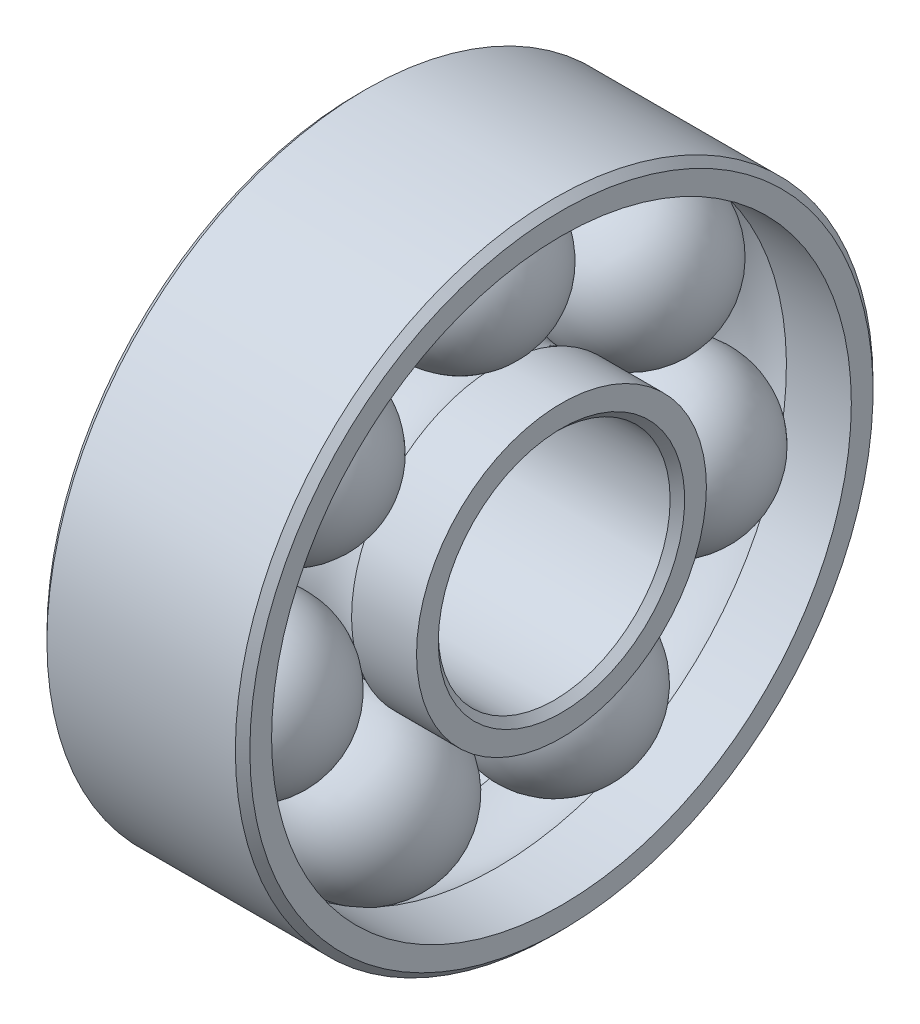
ISO-10303-21;
HEADER;
FILE_DESCRIPTION(('STEP AP214'),'2;1');
FILE_NAME('part.step','',(''),(''),'','','');
FILE_SCHEMA(('AUTOMOTIVE_DESIGN { 1 0 10303 214 1 1 1 1 }'));
ENDSEC;
DATA;
#1=APPLICATION_CONTEXT('core data for automotive mechanical design processes');
#2=APPLICATION_PROTOCOL_DEFINITION('international standard','automotive_design',2000,#1);
#3=PRODUCT_CONTEXT('',#1,'mechanical');
#4=PRODUCT('Part','Part','',(#3));
#5=PRODUCT_RELATED_PRODUCT_CATEGORY('part','',(#4));
#6=PRODUCT_DEFINITION_FORMATION('','',#4);
#7=PRODUCT_DEFINITION_CONTEXT('part definition',#1,'design');
#8=PRODUCT_DEFINITION('design','',#6,#7);
#9=PRODUCT_DEFINITION_SHAPE('','',#8);
#10=(LENGTH_UNIT() NAMED_UNIT(*) SI_UNIT(.MILLI.,.METRE.));
#11=(NAMED_UNIT(*) PLANE_ANGLE_UNIT() SI_UNIT($,.RADIAN.));
#12=(NAMED_UNIT(*) SI_UNIT($,.STERADIAN.) SOLID_ANGLE_UNIT());
#13=UNCERTAINTY_MEASURE_WITH_UNIT(LENGTH_MEASURE(1.E-05),#10,'distance_accuracy_value','');
#14=(GEOMETRIC_REPRESENTATION_CONTEXT(3) GLOBAL_UNCERTAINTY_ASSIGNED_CONTEXT((#13)) GLOBAL_UNIT_ASSIGNED_CONTEXT((#10,
#11,#12)) REPRESENTATION_CONTEXT('',''));
#15=CARTESIAN_POINT('',(0.,0.,0.));
#16=DIRECTION('',(0.,0.,1.));
#17=DIRECTION('',(1.,0.,0.));
#18=AXIS2_PLACEMENT_3D('',#15,#16,#17);
#19=CARTESIAN_POINT('',(0.,7.5,0.));
#20=DIRECTION('',(0.,1.,0.));
#21=DIRECTION('',(0.,0.,-1.));
#22=AXIS2_PLACEMENT_3D('',#19,#20,#21);
#23=SPHERICAL_SURFACE('',#22,2.81);
#24=CARTESIAN_POINT('',(-1.26115202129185,4.9963608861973,0.193356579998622));
#25=CARTESIAN_POINT('',(-1.19085044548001,4.96088655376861,0.192670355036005));
#26=CARTESIAN_POINT('',(-1.11904853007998,4.92839289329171,0.192038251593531));
#27=CARTESIAN_POINT('',(-0.972966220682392,4.86956511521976,0.190889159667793));
#28=CARTESIAN_POINT('',(-0.898685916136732,4.84323077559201,0.190372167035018));
#29=CARTESIAN_POINT('',(-0.748231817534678,4.79693815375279,0.189460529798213));
#30=CARTESIAN_POINT('',(-0.672059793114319,4.77697413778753,0.189065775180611));
#31=CARTESIAN_POINT('',(-0.518327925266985,4.74352821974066,0.188402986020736));
#32=CARTESIAN_POINT('',(-0.440768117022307,4.73004615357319,0.188134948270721));
#33=CARTESIAN_POINT('',(-0.206698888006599,4.69947738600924,0.187526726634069));
#34=CARTESIAN_POINT('',(-0.0487819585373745,4.69226268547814,0.187382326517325));
#35=CARTESIAN_POINT('',(0.265879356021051,4.7044670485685,0.187625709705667));
#36=CARTESIAN_POINT('',(0.422624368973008,4.72387064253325,0.188013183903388));
#37=CARTESIAN_POINT('',(0.695265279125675,4.78124352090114,0.189150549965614));
#38=CARTESIAN_POINT('',(0.812295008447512,4.81394305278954,0.18979711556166));
#39=CARTESIAN_POINT('',(1.04111472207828,4.89417798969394,0.191371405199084));
#40=CARTESIAN_POINT('',(1.15290609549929,4.94170943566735,0.192299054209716));
#41=CARTESIAN_POINT('',(1.26115202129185,4.99636088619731,0.193356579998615));
#42=B_SPLINE_CURVE_WITH_KNOTS('',3,(#24,#25,#26,#27,#28,#29,#30,#31,#32,#33,#34,#35,#36,#37,#38,
#39,#40,#41),.UNSPECIFIED.,.F.,.F.,(4,2,2,2,2,2,2,2,4),(0.,0.236166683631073,0.472324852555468,
0.708269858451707,0.944208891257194,1.41603210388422,1.88758122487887,2.2511341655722,
2.61459014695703),.UNSPECIFIED.);
#43=CARTESIAN_POINT('',(-1.26095202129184,4.99626,0.193354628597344));
#44=VERTEX_POINT('',#43);
#45=CARTESIAN_POINT('',(1.26095202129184,4.99626,0.193354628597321));
#46=VERTEX_POINT('',#45);
#47=EDGE_CURVE('E498',#44,#46,#42,.T.);
#48=ORIENTED_EDGE('',*,*,#47,.T.);
#49=CARTESIAN_POINT('',(1.26075202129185,4.99622637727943,0.194221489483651));
#50=CARTESIAN_POINT('',(1.27173113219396,4.99808960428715,0.147220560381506));
#51=CARTESIAN_POINT('',(1.27863389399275,4.99925858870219,0.0992542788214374));
#52=CARTESIAN_POINT('',(1.28427251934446,5.00021115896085,0.00375030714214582));
#53=CARTESIAN_POINT('',(1.28316211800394,5.00002082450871,-0.0437780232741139));
#54=CARTESIAN_POINT('',(1.27447932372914,4.99854893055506,-0.125649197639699));
#55=CARTESIAN_POINT('',(1.268671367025,4.99756552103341,-0.160192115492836));
#56=CARTESIAN_POINT('',(1.26075202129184,4.99622637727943,-0.194221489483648));
#57=B_SPLINE_CURVE_WITH_KNOTS('',3,(#49,#50,#51,#52,#53,#54,#55,#56),.UNSPECIFIED.,.F.,.F.,(4,2,
2,4),(0.,0.144715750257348,0.286662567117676,0.391516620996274),.UNSPECIFIED.);
#58=CARTESIAN_POINT('',(1.26095202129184,4.99625999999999,-0.193354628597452));
#59=VERTEX_POINT('',#58);
#60=EDGE_CURVE('E684',#46,#59,#57,.T.);
#61=ORIENTED_EDGE('',*,*,#60,.T.);
#62=CARTESIAN_POINT('',(1.26115202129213,4.99636088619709,-0.193356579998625));
#63=CARTESIAN_POINT('',(1.19085044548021,4.96088655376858,-0.192670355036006));
#64=CARTESIAN_POINT('',(1.11904853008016,4.92839289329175,-0.19203825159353));
#65=CARTESIAN_POINT('',(0.972966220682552,4.86956511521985,-0.190889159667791));
#66=CARTESIAN_POINT('',(0.898685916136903,4.84323077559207,-0.190372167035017));
#67=CARTESIAN_POINT('',(0.748231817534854,4.79693815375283,-0.189460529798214));
#68=CARTESIAN_POINT('',(0.672059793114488,4.77697413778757,-0.189065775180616));
#69=CARTESIAN_POINT('',(0.518327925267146,4.74352821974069,-0.188402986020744));
#70=CARTESIAN_POINT('',(0.440768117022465,4.73004615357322,-0.188134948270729));
#71=CARTESIAN_POINT('',(0.206698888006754,4.69947738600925,-0.187526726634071));
#72=CARTESIAN_POINT('',(0.0487819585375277,4.69226268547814,-0.187382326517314));
#73=CARTESIAN_POINT('',(-0.265879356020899,4.70446704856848,-0.18762570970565));
#74=CARTESIAN_POINT('',(-0.422624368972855,4.72387064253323,-0.188013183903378));
#75=CARTESIAN_POINT('',(-0.695265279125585,4.78124352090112,-0.189150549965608));
#76=CARTESIAN_POINT('',(-0.812295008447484,4.81394305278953,-0.189797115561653));
#77=CARTESIAN_POINT('',(-1.04111472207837,4.89417798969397,-0.191371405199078));
#78=CARTESIAN_POINT('',(-1.15290609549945,4.94170943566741,-0.192299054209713));
#79=CARTESIAN_POINT('',(-1.26115202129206,4.99636088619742,-0.19335657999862));
#80=B_SPLINE_CURVE_WITH_KNOTS('',3,(#62,#63,#64,#65,#66,#67,#68,#69,#70,#71,#72,#73,#74,#75,#76,
#77,#78,#79),.UNSPECIFIED.,.F.,.F.,(4,2,2,2,2,2,2,2,4),(0.,0.23616668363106,0.472324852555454,
0.708269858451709,0.944208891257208,1.41603210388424,1.88758122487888,2.25113416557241,
2.61459014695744),.UNSPECIFIED.);
#81=CARTESIAN_POINT('',(-1.26095202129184,4.99626,-0.19335462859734));
#82=VERTEX_POINT('',#81);
#83=EDGE_CURVE('E505',#59,#82,#80,.T.);
#84=ORIENTED_EDGE('',*,*,#83,.T.);
#85=CARTESIAN_POINT('',(-1.26075202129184,4.99622637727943,-0.194221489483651));
#86=CARTESIAN_POINT('',(-1.27173113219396,4.99808960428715,-0.147220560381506));
#87=CARTESIAN_POINT('',(-1.27863389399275,4.99925858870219,-0.0992542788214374));
#88=CARTESIAN_POINT('',(-1.28427251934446,5.00021115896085,-0.0037503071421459));
#89=CARTESIAN_POINT('',(-1.28316211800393,5.00002082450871,0.0437780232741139));
#90=CARTESIAN_POINT('',(-1.27447932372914,4.99854893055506,0.1256491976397));
#91=CARTESIAN_POINT('',(-1.268671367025,4.99756552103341,0.160192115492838));
#92=CARTESIAN_POINT('',(-1.26075202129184,4.99622637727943,0.194221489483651));
#93=B_SPLINE_CURVE_WITH_KNOTS('',3,(#85,#86,#87,#88,#89,#90,#91,#92),.UNSPECIFIED.,.F.,.F.,(4,2,
2,4),(0.,0.144715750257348,0.286662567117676,0.391516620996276),.UNSPECIFIED.);
#94=EDGE_CURVE('E685',#82,#44,#93,.T.);
#95=ORIENTED_EDGE('',*,*,#94,.T.);
#96=EDGE_LOOP('',(#48,#61,#84,#95));
#97=FACE_BOUND('',#96,.T.);
#98=CARTESIAN_POINT('',(1.26075202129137,9.99622637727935,0.274696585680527));
#99=CARTESIAN_POINT('',(1.27558686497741,9.99874212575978,0.183131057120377));
#100=CARTESIAN_POINT('',(1.28300428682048,10.,0.0915655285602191));
#101=CARTESIAN_POINT('',(1.28300428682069,10.,-0.0915655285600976));
#102=CARTESIAN_POINT('',(1.27558686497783,9.99874212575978,-0.183131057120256));
#103=CARTESIAN_POINT('',(1.260752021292,9.99622637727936,-0.274696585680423));
#104=B_SPLINE_CURVE_WITH_KNOTS('',3,(#98,#99,#100,#101,#102,#103),.UNSPECIFIED.,.F.,.F.,(4,2,4),
(0.,0.275622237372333,0.551244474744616),.UNSPECIFIED.);
#105=CARTESIAN_POINT('',(1.26095202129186,9.99625999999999,0.273470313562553));
#106=VERTEX_POINT('',#105);
#107=CARTESIAN_POINT('',(1.26095202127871,9.99626000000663,-0.273470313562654));
#108=VERTEX_POINT('',#107);
#109=EDGE_CURVE('E52',#106,#108,#104,.T.);
#110=ORIENTED_EDGE('',*,*,#109,.F.);
#111=CARTESIAN_POINT('',(-1.26115202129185,9.99615911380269,0.273468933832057));
#112=CARTESIAN_POINT('',(-1.1908436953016,10.031636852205,0.273954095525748));
#113=CARTESIAN_POINT('',(-1.11903494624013,10.0641332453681,0.27439726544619));
#114=CARTESIAN_POINT('',(-0.972938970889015,10.1229651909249,0.275197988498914));
#115=CARTESIAN_POINT('',(-0.898651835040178,10.1493009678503,0.275555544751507));
#116=CARTESIAN_POINT('',(-0.748184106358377,10.1955952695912,0.276183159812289));
#117=CARTESIAN_POINT('',(-0.672005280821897,10.215559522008,0.276453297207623));
#118=CARTESIAN_POINT('',(-0.518259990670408,10.249004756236,0.276905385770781));
#119=CARTESIAN_POINT('',(-0.440693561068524,10.2624859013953,0.277087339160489));
#120=CARTESIAN_POINT('',(-0.206605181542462,10.293050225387,0.27749971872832));
#121=CARTESIAN_POINT('',(-0.0486760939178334,10.3002598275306,0.277596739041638));
#122=CARTESIAN_POINT('',(0.266008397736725,10.2880413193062,0.277432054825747));
#123=CARTESIAN_POINT('',(0.422764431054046,10.2686287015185,0.277170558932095));
#124=CARTESIAN_POINT('',(0.695388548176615,10.2112437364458,0.276395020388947));
#125=CARTESIAN_POINT('',(0.81239171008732,10.1785465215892,0.275952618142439));
#126=CARTESIAN_POINT('',(1.041160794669,10.0983223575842,0.274863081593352));
#127=CARTESIAN_POINT('',(1.15292811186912,10.0507993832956,0.274216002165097));
#128=CARTESIAN_POINT('',(1.26115202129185,9.99615911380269,0.273468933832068));
#129=B_SPLINE_CURVE_WITH_KNOTS('',3,(#111,#112,#113,#114,#115,#116,#117,#118,#119,#120,#121,
#122,#123,#124,#125,#126,#127,#128),.UNSPECIFIED.,.F.,.F.,(4,2,2,2,2,2,2,2,4),(0.,
0.236184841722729,0.472361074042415,0.7083243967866,0.94428177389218,1.41614061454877,
1.88772497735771,2.25119736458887,2.61457238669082),.UNSPECIFIED.);
#130=CARTESIAN_POINT('',(-1.26095202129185,9.99626,0.27347031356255));
#131=VERTEX_POINT('',#130);
#132=EDGE_CURVE('E466',#131,#106,#129,.T.);
#133=ORIENTED_EDGE('',*,*,#132,.F.);
#134=CARTESIAN_POINT('',(-1.26075202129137,9.99622637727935,-0.274696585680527));
#135=CARTESIAN_POINT('',(-1.27558686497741,9.99874212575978,-0.183131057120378));
#136=CARTESIAN_POINT('',(-1.28300428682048,10.,-0.0915655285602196));
#137=CARTESIAN_POINT('',(-1.28300428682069,10.,0.091565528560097));
#138=CARTESIAN_POINT('',(-1.27558686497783,9.99874212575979,0.183131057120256));
#139=CARTESIAN_POINT('',(-1.260752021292,9.99622637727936,0.274696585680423));
#140=B_SPLINE_CURVE_WITH_KNOTS('',3,(#134,#135,#136,#137,#138,#139),.UNSPECIFIED.,.F.,.F.,(4,2,
4),(0.,0.275622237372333,0.551244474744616),.UNSPECIFIED.);
#141=CARTESIAN_POINT('',(-1.26095202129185,9.99626,-0.27347031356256));
#142=VERTEX_POINT('',#141);
#143=EDGE_CURVE('E239',#142,#131,#140,.T.);
#144=ORIENTED_EDGE('',*,*,#143,.F.);
#145=CARTESIAN_POINT('',(1.26115202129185,9.99615911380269,-0.273468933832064));
#146=CARTESIAN_POINT('',(1.1908436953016,10.031636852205,-0.273954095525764));
#147=CARTESIAN_POINT('',(1.11903494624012,10.0641332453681,-0.274397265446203));
#148=CARTESIAN_POINT('',(0.972938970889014,10.1229651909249,-0.275197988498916));
#149=CARTESIAN_POINT('',(0.898651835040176,10.1493009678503,-0.275555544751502));
#150=CARTESIAN_POINT('',(0.748184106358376,10.1955952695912,-0.276183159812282));
#151=CARTESIAN_POINT('',(0.672005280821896,10.215559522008,-0.276453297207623));
#152=CARTESIAN_POINT('',(0.518259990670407,10.249004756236,-0.276905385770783));
#153=CARTESIAN_POINT('',(0.440693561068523,10.2624859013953,-0.277087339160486));
#154=CARTESIAN_POINT('',(0.206605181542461,10.293050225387,-0.277499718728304));
#155=CARTESIAN_POINT('',(0.0486760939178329,10.3002598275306,-0.277596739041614));
#156=CARTESIAN_POINT('',(-0.266008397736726,10.2880413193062,-0.277432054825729));
#157=CARTESIAN_POINT('',(-0.422764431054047,10.2686287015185,-0.277170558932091));
#158=CARTESIAN_POINT('',(-0.695388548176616,10.2112437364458,-0.276395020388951));
#159=CARTESIAN_POINT('',(-0.81239171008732,10.1785465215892,-0.275952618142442));
#160=CARTESIAN_POINT('',(-1.041160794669,10.0983223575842,-0.27486308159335));
#161=CARTESIAN_POINT('',(-1.15292811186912,10.0507993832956,-0.274216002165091));
#162=CARTESIAN_POINT('',(-1.26115202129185,9.99615911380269,-0.273468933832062));
#163=B_SPLINE_CURVE_WITH_KNOTS('',3,(#145,#146,#147,#148,#149,#150,#151,#152,#153,#154,#155,
#156,#157,#158,#159,#160,#161,#162),.UNSPECIFIED.,.F.,.F.,(4,2,2,2,2,2,2,2,4),(0.,
0.23618484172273,0.472361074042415,0.7083243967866,0.94428177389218,1.41614061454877,
1.88772497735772,2.25119736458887,2.61457238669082),.UNSPECIFIED.);
#164=EDGE_CURVE('E48',#108,#142,#163,.T.);
#165=ORIENTED_EDGE('',*,*,#164,.F.);
#166=EDGE_LOOP('',(#110,#133,#144,#165));
#167=FACE_BOUND('',#166,.T.);
#168=ADVANCED_FACE('F28',(#97,#167),#23,.T.);
#169=CARTESIAN_POINT('',(0.,4.67617351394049,5.86373611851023));
#170=DIRECTION('',(0.,0.623489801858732,0.781831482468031));
#171=DIRECTION('',(0.,0.781831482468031,-0.623489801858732));
#172=AXIS2_PLACEMENT_3D('',#169,#170,#171);
#173=SPHERICAL_SURFACE('',#172,2.81);
#174=CARTESIAN_POINT('',(-1.26115202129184,2.9640077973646,4.02686809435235));
#175=CARTESIAN_POINT('',(-1.19085044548,2.9424264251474,3.99870529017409));
#176=CARTESIAN_POINT('',(-1.11904853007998,2.92266115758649,3.97290661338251));
#177=CARTESIAN_POINT('',(-0.972966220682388,2.88688103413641,3.92619675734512));
#178=CARTESIAN_POINT('',(-0.898685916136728,2.87086604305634,3.90528540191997));
#179=CARTESIAN_POINT('',(-0.748231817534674,2.8427158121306,3.86852397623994));
#180=CARTESIAN_POINT('',(-0.672059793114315,2.83057708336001,3.8526693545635));
#181=CARTESIAN_POINT('',(-0.518327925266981,2.8102420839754,3.82610704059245));
#182=CARTESIAN_POINT('',(-0.440768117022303,2.80204571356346,3.81539921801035));
#183=CARTESIAN_POINT('',(-0.206698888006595,2.7834619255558,3.79112037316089));
#184=CARTESIAN_POINT('',(-0.0487819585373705,2.77907652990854,3.78538966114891));
#185=CARTESIAN_POINT('',(0.265879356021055,2.78649554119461,3.7950831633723));
#186=CARTESIAN_POINT('',(0.422624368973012,2.79829054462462,3.81049509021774));
#187=CARTESIAN_POINT('',(0.695265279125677,2.83317272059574,3.85606014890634));
#188=CARTESIAN_POINT('',(0.812295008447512,2.85305503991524,3.88202879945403));
#189=CARTESIAN_POINT('',(1.04111472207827,2.90184987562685,3.94574055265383));
#190=CARTESIAN_POINT('',(1.15290609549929,2.93075998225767,3.9834805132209));
#191=CARTESIAN_POINT('',(1.26115202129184,2.9640077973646,4.02686809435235));
#192=B_SPLINE_CURVE_WITH_KNOTS('',3,(#174,#175,#176,#177,#178,#179,#180,#181,#182,#183,#184,
#185,#186,#187,#188,#189,#190,#191),.UNSPECIFIED.,.F.,.F.,(4,2,2,2,2,2,2,2,4),(0.,
0.236166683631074,0.472324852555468,0.708269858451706,0.944208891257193,1.41603210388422,
1.88758122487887,2.2511341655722,2.61459014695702),.UNSPECIFIED.);
#193=CARTESIAN_POINT('',(-1.26095202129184,2.96394642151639,4.02678800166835));
#194=VERTEX_POINT('',#193);
#195=CARTESIAN_POINT('',(1.26095202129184,2.96394642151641,4.02678800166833));
#196=VERTEX_POINT('',#195);
#197=EDGE_CURVE('E363',#194,#196,#192,.T.);
#198=ORIENTED_EDGE('',*,*,#197,.T.);
#199=CARTESIAN_POINT('',(1.26075202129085,2.96324771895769,4.02730219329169));
#200=CARTESIAN_POINT('',(1.27173113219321,3.00115622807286,3.99945432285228));
#201=CARTESIAN_POINT('',(1.27863389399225,3.03938662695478,3.97046178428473));
#202=CARTESIAN_POINT('',(1.28427251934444,3.11464855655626,3.91166078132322));
#203=CARTESIAN_POINT('',(1.28316211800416,3.15168902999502,3.88187854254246));
#204=CARTESIAN_POINT('',(1.27447932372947,3.21478078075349,3.82968192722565));
#205=CARTESIAN_POINT('',(1.26867136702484,3.24117437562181,3.80737590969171));
#206=CARTESIAN_POINT('',(1.26075202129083,3.2669446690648,3.78511195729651));
#207=B_SPLINE_CURVE_WITH_KNOTS('',3,(#199,#200,#201,#202,#203,#204,#205,#206),.UNSPECIFIED.,.F.,
.F.,(4,2,2,4),(0.,0.144715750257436,0.286662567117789,0.391516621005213),.UNSPECIFIED.);
#208=CARTESIAN_POINT('',(1.26095202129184,3.2662878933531,3.78567872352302));
#209=VERTEX_POINT('',#208);
#210=EDGE_CURVE('E377',#196,#209,#207,.T.);
#211=ORIENTED_EDGE('',*,*,#210,.T.);
#212=CARTESIAN_POINT('',(1.26115202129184,3.26635232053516,3.78575638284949));
#213=CARTESIAN_POINT('',(1.19085044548,3.24369792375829,3.75844928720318));
#214=CARTESIAN_POINT('',(1.11904853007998,3.22294425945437,3.73343883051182));
#215=CARTESIAN_POINT('',(0.972966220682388,3.1853673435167,3.68816186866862));
#216=CARTESIAN_POINT('',(0.898685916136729,3.16854395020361,3.66789519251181));
#217=CARTESIAN_POINT('',(0.748231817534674,3.13896822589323,3.63227055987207));
#218=CARTESIAN_POINT('',(0.672059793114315,3.12621223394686,3.61690818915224));
#219=CARTESIAN_POINT('',(0.518327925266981,3.1048408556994,3.59117235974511));
#220=CARTESIAN_POINT('',(0.440768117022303,3.09622536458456,3.58079877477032));
#221=CARTESIAN_POINT('',(0.206698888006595,3.07669052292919,3.55727836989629));
#222=CARTESIAN_POINT('',(0.0487819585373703,3.07207933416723,3.55172772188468));
#223=CARTESIAN_POINT('',(-0.265879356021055,3.0798789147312,3.56111773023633));
#224=CARTESIAN_POINT('',(-0.422624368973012,3.09227979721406,3.57604648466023));
#225=CARTESIAN_POINT('',(-0.695265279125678,3.12894043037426,3.62019327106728));
#226=CARTESIAN_POINT('',(-0.812295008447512,3.1498337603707,3.64535566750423));
#227=CARTESIAN_POINT('',(-1.04111472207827,3.20109025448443,3.70710431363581));
#228=CARTESIAN_POINT('',(-1.15290609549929,3.23145089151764,3.74368751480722));
#229=CARTESIAN_POINT('',(-1.26115202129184,3.26635232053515,3.7857563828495));
#230=B_SPLINE_CURVE_WITH_KNOTS('',3,(#212,#213,#214,#215,#216,#217,#218,#219,#220,#221,#222,
#223,#224,#225,#226,#227,#228,#229),.UNSPECIFIED.,.F.,.F.,(4,2,2,2,2,2,2,2,4),(0.,
0.236166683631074,0.472324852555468,0.708269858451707,0.944208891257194,1.41603210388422,
1.88758122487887,2.2511341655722,2.61459014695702),.UNSPECIFIED.);
#231=CARTESIAN_POINT('',(-1.26095202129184,3.26628789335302,3.7856787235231));
#232=VERTEX_POINT('',#231);
#233=EDGE_CURVE('E371',#209,#232,#230,.T.);
#234=ORIENTED_EDGE('',*,*,#233,.T.);
#235=CARTESIAN_POINT('',(-1.26075202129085,3.26694466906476,3.78511195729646));
#236=CARTESIAN_POINT('',(-1.2717311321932,3.23135956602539,3.8158732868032));
#237=CARTESIAN_POINT('',(-1.27863389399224,3.19458686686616,3.84669372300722));
#238=CARTESIAN_POINT('',(-1.28427251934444,3.12051277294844,3.90698422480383));
#239=CARTESIAN_POINT('',(-1.28316211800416,3.08323495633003,3.9364688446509));
#240=CARTESIAN_POINT('',(-1.27447932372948,3.01830778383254,3.98636391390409));
#241=CARTESIAN_POINT('',(-1.26867136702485,2.99068789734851,4.00713221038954));
#242=CARTESIAN_POINT('',(-1.26075202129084,2.96324771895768,4.02730219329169));
#243=B_SPLINE_CURVE_WITH_KNOTS('',3,(#235,#236,#237,#238,#239,#240,#241,#242),.UNSPECIFIED.,.F.,
.F.,(4,2,2,4),(0.,0.144715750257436,0.286662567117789,0.391516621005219),.UNSPECIFIED.);
#244=EDGE_CURVE('E352',#232,#194,#243,.T.);
#245=ORIENTED_EDGE('',*,*,#244,.T.);
#246=EDGE_LOOP('',(#198,#211,#234,#245));
#247=FACE_BOUND('',#246,.T.);
#248=CARTESIAN_POINT('',(1.26075202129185,6.01777876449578,7.98663500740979));
#249=CARTESIAN_POINT('',(1.27558686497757,6.09093612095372,7.93151172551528));
#250=CARTESIAN_POINT('',(1.28300428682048,6.16330920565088,7.87540499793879));
#251=CARTESIAN_POINT('',(1.28300428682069,6.30648683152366,7.7612246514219));
#252=CARTESIAN_POINT('',(1.27558686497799,6.37729137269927,7.70315103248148));
#253=CARTESIAN_POINT('',(1.26075202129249,6.44731164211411,7.6440939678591));
#254=B_SPLINE_CURVE_WITH_KNOTS('',3,(#248,#249,#250,#251,#252,#253),.UNSPECIFIED.,.F.,.F.,(4,2,
4),(0.,0.275622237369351,0.551244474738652),.UNSPECIFIED.);
#255=CARTESIAN_POINT('',(1.26095202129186,6.01875846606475,7.98589672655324));
#256=VERTEX_POINT('',#255);
#257=CARTESIAN_POINT('',(1.26095202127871,6.44637386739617,7.64488482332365));
#258=VERTEX_POINT('',#257);
#259=EDGE_CURVE('E221',#256,#258,#254,.T.);
#260=ORIENTED_EDGE('',*,*,#259,.F.);
#261=CARTESIAN_POINT('',(-1.26115202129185,6.01869664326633,7.98581699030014));
#262=CARTESIAN_POINT('',(-1.1908436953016,6.04043733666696,8.01385709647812));
#263=CARTESIAN_POINT('',(-1.11903494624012,6.06035202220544,8.03954011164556));
#264=CARTESIAN_POINT('',(-0.972938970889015,6.09640710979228,8.08603602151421));
#265=CARTESIAN_POINT('',(-0.898651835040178,6.11254764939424,8.10684909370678));
#266=CARTESIAN_POINT('',(-0.748184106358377,6.14092098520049,8.1434347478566));
#267=CARTESIAN_POINT('',(-0.672005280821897,6.15315729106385,8.15921185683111));
#268=CARTESIAN_POINT('',(-0.518259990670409,6.17365659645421,8.1856422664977));
#269=CARTESIAN_POINT('',(-0.440693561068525,6.18191969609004,8.1962956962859));
#270=CARTESIAN_POINT('',(-0.206605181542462,6.20065382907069,8.22044896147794));
#271=CARTESIAN_POINT('',(-0.0486760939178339,6.20507308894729,8.2261461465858));
#272=CARTESIAN_POINT('',(0.266008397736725,6.19758372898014,8.21649065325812));
#273=CARTESIAN_POINT('',(0.422764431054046,6.18568460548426,8.20115021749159));
#274=CARTESIAN_POINT('',(0.695388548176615,6.15051200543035,8.15580130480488));
#275=CARTESIAN_POINT('',(0.812391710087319,6.13047150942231,8.12996175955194));
#276=CARTESIAN_POINT('',(1.041160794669,6.0813043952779,8.06656066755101));
#277=CARTESIAN_POINT('',(1.15292811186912,6.05218021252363,8.02900226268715));
#278=CARTESIAN_POINT('',(1.26115202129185,6.01869664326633,7.98581699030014));
#279=B_SPLINE_CURVE_WITH_KNOTS('',3,(#261,#262,#263,#264,#265,#266,#267,#268,#269,#270,#271,
#272,#273,#274,#275,#276,#277,#278),.UNSPECIFIED.,.F.,.F.,(4,2,2,2,2,2,2,2,4),(0.,
0.236184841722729,0.472361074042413,0.708324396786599,0.944281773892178,1.41614061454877,
1.88772497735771,2.25119736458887,2.61457238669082),.UNSPECIFIED.);
#280=CARTESIAN_POINT('',(-1.26095202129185,6.01875846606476,7.98589672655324));
#281=VERTEX_POINT('',#280);
#282=EDGE_CURVE('E215',#281,#256,#279,.T.);
#283=ORIENTED_EDGE('',*,*,#282,.F.);
#284=CARTESIAN_POINT('',(-1.26075202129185,6.44731164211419,7.64409396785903));
#285=CARTESIAN_POINT('',(-1.27558686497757,6.37729137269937,7.7031510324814));
#286=CARTESIAN_POINT('',(-1.28300428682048,6.30648683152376,7.76122465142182));
#287=CARTESIAN_POINT('',(-1.28300428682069,6.16330920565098,7.87540499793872));
#288=CARTESIAN_POINT('',(-1.27558686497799,6.09093612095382,7.9315117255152));
#289=CARTESIAN_POINT('',(-1.26075202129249,6.01777876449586,7.98663500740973));
#290=B_SPLINE_CURVE_WITH_KNOTS('',3,(#284,#285,#286,#287,#288,#289),.UNSPECIFIED.,.F.,.F.,(4,2,
4),(0.,0.275622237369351,0.551244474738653),.UNSPECIFIED.);
#291=CARTESIAN_POINT('',(-1.26095202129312,6.44637386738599,7.64488482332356));
#292=VERTEX_POINT('',#291);
#293=EDGE_CURVE('E218',#292,#281,#290,.T.);
#294=ORIENTED_EDGE('',*,*,#293,.F.);
#295=CARTESIAN_POINT('',(1.26115202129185,6.44630988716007,7.64480680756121));
#296=CARTESIAN_POINT('',(1.1908436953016,6.46880920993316,7.67224192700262));
#297=CARTESIAN_POINT('',(1.11903494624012,6.48941686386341,7.69737231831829));
#298=CARTESIAN_POINT('',(0.972938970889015,6.52672401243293,7.74286974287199));
#299=CARTESIAN_POINT('',(0.898651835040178,6.54342364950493,7.76323694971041));
#300=CARTESIAN_POINT('',(0.748184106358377,6.57277836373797,7.79903998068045));
#301=CARTESIAN_POINT('',(0.672005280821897,6.58543707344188,7.81448023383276));
#302=CARTESIAN_POINT('',(0.518259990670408,6.60664329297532,7.84034689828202));
#303=CARTESIAN_POINT('',(0.440693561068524,6.61519090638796,7.85077343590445));
#304=CARTESIAN_POINT('',(0.206605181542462,6.63456986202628,7.87441247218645));
#305=CARTESIAN_POINT('',(0.0486760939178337,6.63914082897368,7.87998867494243));
#306=CARTESIAN_POINT('',(-0.266008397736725,6.63139395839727,7.87053853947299));
#307=CARTESIAN_POINT('',(-0.422764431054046,6.619085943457,7.8555241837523));
#308=CARTESIAN_POINT('',(-0.695388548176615,6.5827006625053,7.81114235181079));
#309=CARTESIAN_POINT('',(-0.81239171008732,6.56196839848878,7.78585447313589));
#310=CARTESIAN_POINT('',(-1.041160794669,6.51109761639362,7.72381201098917));
#311=CARTESIAN_POINT('',(-1.15292811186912,6.48096161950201,7.68706050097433));
#312=CARTESIAN_POINT('',(-1.26115202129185,6.44630988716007,7.64480680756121));
#313=B_SPLINE_CURVE_WITH_KNOTS('',3,(#295,#296,#297,#298,#299,#300,#301,#302,#303,#304,#305,
#306,#307,#308,#309,#310,#311,#312),.UNSPECIFIED.,.F.,.F.,(4,2,2,2,2,2,2,2,4),(0.,
0.236184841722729,0.472361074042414,0.7083243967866,0.944281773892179,1.41614061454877,
1.88772497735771,2.25119736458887,2.61457238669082),.UNSPECIFIED.);
#314=EDGE_CURVE('E226',#258,#292,#313,.T.);
#315=ORIENTED_EDGE('',*,*,#314,.F.);
#316=EDGE_LOOP('',(#260,#283,#294,#315));
#317=FACE_BOUND('',#316,.T.);
#318=ADVANCED_FACE('F217',(#247,#317),#173,.T.);
#319=CARTESIAN_POINT('',(0.,-1.66890700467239,7.31195934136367));
#320=DIRECTION('',(0.,-0.222520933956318,0.974927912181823));
#321=DIRECTION('',(0.,0.974927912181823,0.222520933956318));
#322=AXIS2_PLACEMENT_3D('',#319,#320,#321);
#323=SPHERICAL_SURFACE('',#322,2.81);
#324=CARTESIAN_POINT('',(-1.26115202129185,-1.30030361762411,4.82806580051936));
#325=CARTESIAN_POINT('',(-1.19085044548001,-1.29174081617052,4.7936335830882));
#326=CARTESIAN_POINT('',(-1.11904853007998,-1.28389404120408,4.76209526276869));
#327=CARTESIAN_POINT('',(-0.972966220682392,-1.26968334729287,4.70499811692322));
#328=CARTESIAN_POINT('',(-0.898685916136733,-1.26331937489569,4.67943907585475));
#329=CARTESIAN_POINT('',(-0.748231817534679,-1.2521295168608,4.63450996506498));
#330=CARTESIAN_POINT('',(-0.67205979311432,-1.24730224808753,4.6151343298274));
#331=CARTESIAN_POINT('',(-0.518327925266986,-1.23921365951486,4.58267445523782));
#332=CARTESIAN_POINT('',(-0.440768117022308,-1.2359523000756,4.56959005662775));
#333=CARTESIAN_POINT('',(-0.2066988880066,-1.22855713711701,4.5399230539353));
#334=CARTESIAN_POINT('',(-0.0487819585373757,-1.22681093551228,4.53292137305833));
#335=CARTESIAN_POINT('',(0.26587935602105,-1.22976394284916,4.54476558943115));
#336=CARTESIAN_POINT('',(0.422624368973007,-1.23445940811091,4.56359647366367));
#337=CARTESIAN_POINT('',(0.695265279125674,-1.24833492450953,4.61927780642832));
#338=CARTESIAN_POINT('',(0.812295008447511,-1.25624160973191,4.65101361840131));
#339=CARTESIAN_POINT('',(1.04111472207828,-1.27563038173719,4.72888658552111));
#340=CARTESIAN_POINT('',(1.15290609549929,-1.28711151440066,4.77501989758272));
#341=CARTESIAN_POINT('',(1.26115202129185,-1.30030361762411,4.82806580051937));
#342=B_SPLINE_CURVE_WITH_KNOTS('',3,(#324,#325,#326,#327,#328,#329,#330,#331,#332,#333,#334,
#335,#336,#337,#338,#339,#340,#341),.UNSPECIFIED.,.F.,.F.,(4,2,2,2,2,2,2,2,4),(0.,
0.236166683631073,0.472324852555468,0.708269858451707,0.944208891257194,1.41603210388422,
1.88758122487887,2.2511341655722,2.61459014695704),.UNSPECIFIED.);
#343=CARTESIAN_POINT('',(-1.26095202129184,-1.30027926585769,4.82796787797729));
#344=VERTEX_POINT('',#343);
#345=CARTESIAN_POINT('',(1.26095202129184,-1.30027926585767,4.8279678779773));
#346=VERTEX_POINT('',#345);
#347=EDGE_CURVE('E514',#344,#346,#342,.T.);
#348=ORIENTED_EDGE('',*,*,#347,.T.);
#349=CARTESIAN_POINT('',(1.26075202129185,-1.30111691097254,4.8277422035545));
#350=CARTESIAN_POINT('',(1.27173113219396,-1.25570900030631,4.84001740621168));
#351=CARTESIAN_POINT('',(1.27863389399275,-1.20920545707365,4.85183058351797));
#352=CARTESIAN_POINT('',(1.28427251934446,-1.1163079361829,4.87401090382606));
#353=CARTESIAN_POINT('',(1.28316211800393,-1.06992888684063,4.88440138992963));
#354=CARTESIAN_POINT('',(1.27447932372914,-0.98978286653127,4.90118444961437));
#355=CARTESIAN_POINT('',(1.268671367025,-0.955887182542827,4.90791221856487));
#356=CARTESIAN_POINT('',(1.26075202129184,-0.922413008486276,4.91417889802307));
#357=B_SPLINE_CURVE_WITH_KNOTS('',3,(#349,#350,#351,#352,#353,#354,#355,#356),.UNSPECIFIED.,.F.,
.F.,(4,2,2,4),(0.,0.144715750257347,0.286662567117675,0.391516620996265),.UNSPECIFIED.);
#358=CARTESIAN_POINT('',(1.26095202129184,-0.923265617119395,4.91401878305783));
#359=VERTEX_POINT('',#358);
#360=EDGE_CURVE('E692',#346,#359,#357,.T.);
#361=ORIENTED_EDGE('',*,*,#360,.T.);
#362=CARTESIAN_POINT('',(1.26115202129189,-0.923286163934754,4.91411757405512));
#363=CARTESIAN_POINT('',(1.19085044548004,-0.916061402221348,4.87937995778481));
#364=CARTESIAN_POINT('',(1.11904853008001,-0.909447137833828,4.84756032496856));
#365=CARTESIAN_POINT('',(0.972966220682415,-0.897477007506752,4.78995178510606));
#366=CARTESIAN_POINT('',(0.898685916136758,-0.892121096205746,4.76416266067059));
#367=CARTESIAN_POINT('',(0.748231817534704,-0.882708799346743,4.7188278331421));
#368=CARTESIAN_POINT('',(0.672059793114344,-0.878651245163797,4.69927651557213));
#369=CARTESIAN_POINT('',(0.518327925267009,-0.871854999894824,4.66652167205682));
#370=CARTESIAN_POINT('',(0.44076811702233,-0.869116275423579,4.6533179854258));
#371=CARTESIAN_POINT('',(0.206698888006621,-0.862907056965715,4.62338029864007));
#372=CARTESIAN_POINT('',(0.0487819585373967,-0.861442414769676,4.61631435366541));
#373=CARTESIAN_POINT('',(-0.265879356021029,-0.863920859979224,4.62826688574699));
#374=CARTESIAN_POINT('',(-0.422624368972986,-0.86786080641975,4.64727021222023));
#375=CARTESIAN_POINT('',(-0.695265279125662,-0.879518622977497,4.70345772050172));
#376=CARTESIAN_POINT('',(-0.812295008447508,-0.886164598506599,4.73548128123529));
#377=CARTESIAN_POINT('',(-1.04111472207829,-0.902483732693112,4.81405487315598));
#378=CARTESIAN_POINT('',(-1.15290609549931,-0.912156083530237,4.86060102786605));
#379=CARTESIAN_POINT('',(-1.26115202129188,-0.923286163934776,4.91411757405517));
#380=B_SPLINE_CURVE_WITH_KNOTS('',3,(#362,#363,#364,#365,#366,#367,#368,#369,#370,#371,#372,
#373,#374,#375,#376,#377,#378,#379),.UNSPECIFIED.,.F.,.F.,(4,2,2,2,2,2,2,2,4),(0.,
0.236166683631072,0.472324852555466,0.708269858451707,0.944208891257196,1.41603210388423,
1.88758122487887,2.25113416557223,2.61459014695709),.UNSPECIFIED.);
#381=CARTESIAN_POINT('',(-1.26095202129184,-0.923265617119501,4.91401878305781));
#382=VERTEX_POINT('',#381);
#383=EDGE_CURVE('E521',#359,#382,#380,.T.);
#384=ORIENTED_EDGE('',*,*,#383,.T.);
#385=CARTESIAN_POINT('',(-1.26075202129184,-0.922413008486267,4.91417889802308));
#386=CARTESIAN_POINT('',(-1.27173113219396,-0.968650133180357,4.90553671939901));
#387=CARTESIAN_POINT('',(-1.27863389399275,-1.01567392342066,4.89600289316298));
#388=CARTESIAN_POINT('',(-1.28427251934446,-1.10899537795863,4.87567994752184));
#389=CARTESIAN_POINT('',(-1.28316211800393,-1.15528972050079,4.8649183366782));
#390=CARTESIAN_POINT('',(-1.27447932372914,-1.23478068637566,4.84526529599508));
#391=CARTESIAN_POINT('',(-1.268671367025,-1.26823871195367,4.83662002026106));
#392=CARTESIAN_POINT('',(-1.26075202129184,-1.30111691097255,4.8277422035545));
#393=B_SPLINE_CURVE_WITH_KNOTS('',3,(#385,#386,#387,#388,#389,#390,#391,#392),.UNSPECIFIED.,.F.,
.F.,(4,2,2,4),(0.,0.144715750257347,0.286662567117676,0.391516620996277),.UNSPECIFIED.);
#394=EDGE_CURVE('E764',#382,#344,#393,.T.);
#395=ORIENTED_EDGE('',*,*,#394,.T.);
#396=EDGE_LOOP('',(#348,#361,#384,#395));
#397=FACE_BOUND('',#396,.T.);
#398=CARTESIAN_POINT('',(1.26075202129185,-2.49217899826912,9.68447437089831));
#399=CARTESIAN_POINT('',(1.27558686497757,-2.40346901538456,9.70730229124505));
#400=CARTESIAN_POINT('',(1.28300428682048,-2.31447912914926,9.72890387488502));
#401=CARTESIAN_POINT('',(1.28300428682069,-2.13593954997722,9.76965436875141));
#402=CARTESIAN_POINT('',(1.27558686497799,-2.04638985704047,9.78880327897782));
#403=CARTESIAN_POINT('',(1.26075202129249,-1.95656026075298,9.80672585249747));
#404=B_SPLINE_CURVE_WITH_KNOTS('',3,(#398,#399,#400,#401,#402,#403),.UNSPECIFIED.,.F.,.F.,(4,2,
4),(0.,0.275622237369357,0.551244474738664),.UNSPECIFIED.);
#405=CARTESIAN_POINT('',(1.26095202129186,-2.49099095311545,9.68478002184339));
#406=VERTEX_POINT('',#405);
#407=CARTESIAN_POINT('',(1.26095202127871,-1.95776326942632,9.80648576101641));
#408=VERTEX_POINT('',#407);
#409=EDGE_CURVE('E603',#406,#408,#404,.T.);
#410=ORIENTED_EDGE('',*,*,#409,.F.);
#411=CARTESIAN_POINT('',(-1.26115202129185,-2.49096715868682,9.68468197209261));
#412=CARTESIAN_POINT('',(-1.1908436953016,-2.49933469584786,9.71916225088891));
#413=CARTESIAN_POINT('',(-1.11903494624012,-2.50699788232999,9.75074527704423));
#414=CARTESIAN_POINT('',(-0.972938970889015,-2.52086986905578,9.80792400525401));
#415=CARTESIAN_POINT('',(-0.898651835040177,-2.5270787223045,9.83351992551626));
#416=CARTESIAN_POINT('',(-0.748184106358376,-2.53799205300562,9.87851387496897));
#417=CARTESIAN_POINT('',(-0.672005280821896,-2.542697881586,9.89791747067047));
#418=CARTESIAN_POINT('',(-0.518259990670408,-2.55058090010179,9.93042356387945));
#419=CARTESIAN_POINT('',(-0.440693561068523,-2.55375812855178,9.94352622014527));
#420=CARTESIAN_POINT('',(-0.206605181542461,-2.56096137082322,9.97323246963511));
#421=CARTESIAN_POINT('',(-0.0486760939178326,-2.56266024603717,9.98023972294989));
#422=CARTESIAN_POINT('',(0.266008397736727,-2.5597808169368,9.96836420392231));
#423=CARTESIAN_POINT('',(0.422764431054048,-2.55520616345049,9.94949648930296));
#424=CARTESIAN_POINT('',(0.695388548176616,-2.54168071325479,9.89372285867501));
#425=CARTESIAN_POINT('',(0.812391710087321,-2.53397358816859,9.86194387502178));
#426=CARTESIAN_POINT('',(1.041160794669,-2.51505981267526,9.78397354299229));
#427=CARTESIAN_POINT('',(1.15292811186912,-2.50385410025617,9.73778605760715));
#428=CARTESIAN_POINT('',(1.26115202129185,-2.49096715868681,9.68468197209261));
#429=B_SPLINE_CURVE_WITH_KNOTS('',3,(#411,#412,#413,#414,#415,#416,#417,#418,#419,#420,#421,
#422,#423,#424,#425,#426,#427,#428),.UNSPECIFIED.,.F.,.F.,(4,2,2,2,2,2,2,2,4),(0.,
0.236184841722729,0.472361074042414,0.7083243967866,0.94428177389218,1.41614061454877,
1.88772497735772,2.25119736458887,2.61457238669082),.UNSPECIFIED.);
#430=CARTESIAN_POINT('',(-1.26095202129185,-2.49099095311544,9.6847800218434));
#431=VERTEX_POINT('',#430);
#432=EDGE_CURVE('E460',#431,#406,#429,.T.);
#433=ORIENTED_EDGE('',*,*,#432,.F.);
#434=CARTESIAN_POINT('',(-1.26075202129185,-1.95656026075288,9.80672585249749));
#435=CARTESIAN_POINT('',(-1.27558686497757,-2.04638985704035,9.78880327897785));
#436=CARTESIAN_POINT('',(-1.28300428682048,-2.1359395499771,9.76965436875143));
#437=CARTESIAN_POINT('',(-1.28300428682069,-2.31447912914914,9.72890387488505));
#438=CARTESIAN_POINT('',(-1.27558686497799,-2.40346901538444,9.70730229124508));
#439=CARTESIAN_POINT('',(-1.26075202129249,-2.49217899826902,9.68447437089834));
#440=B_SPLINE_CURVE_WITH_KNOTS('',3,(#434,#435,#436,#437,#438,#439),.UNSPECIFIED.,.F.,.F.,(4,2,
4),(0.,0.275622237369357,0.551244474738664),.UNSPECIFIED.);
#441=CARTESIAN_POINT('',(-1.26095202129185,-1.95776326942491,9.80648576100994));
#442=VERTEX_POINT('',#441);
#443=EDGE_CURVE('E240',#442,#431,#440,.T.);
#444=ORIENTED_EDGE('',*,*,#443,.F.);
#445=CARTESIAN_POINT('',(1.26115202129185,-1.95774216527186,9.80638709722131));
#446=CARTESIAN_POINT('',(1.1908436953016,-1.96516370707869,9.84108329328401));
#447=CARTESIAN_POINT('',(1.11903494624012,-1.97196277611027,9.87286354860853));
#448=CARTESIAN_POINT('',(0.972938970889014,-1.98427346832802,9.93039863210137));
#449=CARTESIAN_POINT('',(0.898651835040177,-1.98978513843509,9.95615367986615));
#450=CARTESIAN_POINT('',(0.748184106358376,-1.99947471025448,10.0014269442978));
#451=CARTESIAN_POINT('',(0.672005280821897,-2.00365380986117,10.0209507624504));
#452=CARTESIAN_POINT('',(0.518259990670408,-2.01065532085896,10.0536580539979));
#453=CARTESIAN_POINT('',(0.440693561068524,-2.01347776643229,10.0668416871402));
#454=CARTESIAN_POINT('',(0.206605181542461,-2.01987692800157,10.0967314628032));
#455=CARTESIAN_POINT('',(0.048676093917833,-2.02138662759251,10.1037818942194));
#456=CARTESIAN_POINT('',(-0.266008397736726,-2.01882830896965,10.0918330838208));
#457=CARTESIAN_POINT('',(-0.422764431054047,-2.01476353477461,10.0728489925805));
#458=CARTESIAN_POINT('',(-0.695388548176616,-2.00275027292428,10.0167302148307));
#459=CARTESIAN_POINT('',(-0.81239171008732,-1.99590576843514,9.98475434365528));
#460=CARTESIAN_POINT('',(-1.041160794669,-1.97911643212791,9.90629912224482));
#461=CARTESIAN_POINT('',(-1.15292811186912,-1.96917243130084,9.85982365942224));
#462=CARTESIAN_POINT('',(-1.26115202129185,-1.95774216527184,9.80638709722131));
#463=B_SPLINE_CURVE_WITH_KNOTS('',3,(#445,#446,#447,#448,#449,#450,#451,#452,#453,#454,#455,
#456,#457,#458,#459,#460,#461,#462),.UNSPECIFIED.,.F.,.F.,(4,2,2,2,2,2,2,2,4),(0.,
0.23618484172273,0.472361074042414,0.7083243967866,0.94428177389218,1.41614061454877,
1.88772497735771,2.25119736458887,2.61457238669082),.UNSPECIFIED.);
#464=EDGE_CURVE('E227',#408,#442,#463,.T.);
#465=ORIENTED_EDGE('',*,*,#464,.F.);
#466=EDGE_LOOP('',(#410,#433,#444,#465));
#467=FACE_BOUND('',#466,.T.);
#468=ADVANCED_FACE('F344',(#397,#467),#323,.T.);
#469=CARTESIAN_POINT('',(0.,-6.75726650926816,3.25412804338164));
#470=DIRECTION('',(0.,-0.900968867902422,0.433883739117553));
#471=DIRECTION('',(0.,0.433883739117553,0.900968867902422));
#472=AXIS2_PLACEMENT_3D('',#469,#470,#471);
#473=SPHERICAL_SURFACE('',#472,2.81);
#474=CARTESIAN_POINT('',(-1.26115202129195,-4.58545988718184,1.9936314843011));
#475=CARTESIAN_POINT('',(-1.19085044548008,-4.55320087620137,1.97885801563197));
#476=CARTESIAN_POINT('',(-1.11904853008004,-4.52365084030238,1.96532905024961));
#477=CARTESIAN_POINT('',(-0.972966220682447,-4.47015027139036,1.94083992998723));
#478=CARTESIAN_POINT('',(-0.898685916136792,-4.44619953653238,1.92987968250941));
#479=CARTESIAN_POINT('',(-0.74823181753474,-4.40409578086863,1.91061542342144));
#480=CARTESIAN_POINT('',(-0.672059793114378,-4.38593754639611,1.90230902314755));
#481=CARTESIAN_POINT('',(-0.518327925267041,-4.35551624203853,1.88839453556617));
#482=CARTESIAN_POINT('',(-0.440768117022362,-4.34325302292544,1.88278637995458));
#483=CARTESIAN_POINT('',(-0.206698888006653,-4.31544761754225,1.87007107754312));
#484=CARTESIAN_POINT('',(-0.0487819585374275,-4.3088847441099,1.86707083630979));
#485=CARTESIAN_POINT('',(0.265879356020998,-4.31998609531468,1.87214683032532));
#486=CARTESIAN_POINT('',(0.422624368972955,-4.33763624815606,1.8802166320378));
#487=CARTESIAN_POINT('',(0.695265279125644,-4.3898209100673,1.90408505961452));
#488=CARTESIAN_POINT('',(0.812295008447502,-4.41956270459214,1.91769031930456));
#489=CARTESIAN_POINT('',(1.04111472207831,-4.49253494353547,1.95108456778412));
#490=CARTESIAN_POINT('',(1.15290609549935,-4.53576178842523,1.97087190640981));
#491=CARTESIAN_POINT('',(1.26115202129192,-4.58545988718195,1.99363148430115));
#492=B_SPLINE_CURVE_WITH_KNOTS('',3,(#474,#475,#476,#477,#478,#479,#480,#481,#482,#483,#484,
#485,#486,#487,#488,#489,#490,#491),.UNSPECIFIED.,.F.,.F.,(4,2,2,2,2,2,2,2,4),(0.,
0.236166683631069,0.472324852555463,0.708269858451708,0.944208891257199,1.41603210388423,
1.88758122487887,2.25113416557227,2.61459014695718),.UNSPECIFIED.);
#493=CARTESIAN_POINT('',(-1.26095202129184,-4.58536814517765,1.99358946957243));
#494=VERTEX_POINT('',#493);
#495=CARTESIAN_POINT('',(1.26095202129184,-4.58536814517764,1.99358946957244));
#496=VERTEX_POINT('',#495);
#497=EDGE_CURVE('E527',#494,#496,#492,.T.);
#498=ORIENTED_EDGE('',*,*,#497,.T.);
#499=CARTESIAN_POINT('',(1.26075202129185,-4.58571396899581,1.99279386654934));
#500=CARTESIAN_POINT('',(1.27173113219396,-4.56699973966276,2.0359486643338));
#501=CARTESIAN_POINT('',(1.27863389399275,-4.54724116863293,2.07967199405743));
#502=CARTESIAN_POINT('',(1.28427251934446,-4.50666178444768,2.1661314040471));
#503=CARTESIAN_POINT('',(1.28316211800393,-4.4858685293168,2.20887036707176));
#504=CARTESIAN_POINT('',(1.27447932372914,-4.44901982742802,2.28199511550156));
#505=CARTESIAN_POINT('',(1.268671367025,-4.43314619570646,2.31269052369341));
#506=CARTESIAN_POINT('',(1.26075202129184,-4.41717487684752,2.34276889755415));
#507=B_SPLINE_CURVE_WITH_KNOTS('',3,(#499,#500,#501,#502,#503,#504,#505,#506),.UNSPECIFIED.,.F.,
.F.,(4,2,2,4),(0.,0.144715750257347,0.286662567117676,0.391516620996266),.UNSPECIFIED.);
#508=CARTESIAN_POINT('',(1.26095202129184,-4.4175812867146,2.3420024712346));
#509=VERTEX_POINT('',#508);
#510=EDGE_CURVE('E703',#496,#509,#507,.T.);
#511=ORIENTED_EDGE('',*,*,#510,.T.);
#512=CARTESIAN_POINT('',(1.26115202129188,-4.41767133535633,2.3420480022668));
#513=CARTESIAN_POINT('',(1.19085044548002,-4.38600780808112,2.32603799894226));
#514=CARTESIAN_POINT('',(1.11904853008,-4.35700629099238,2.31137002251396));
#515=CARTESIAN_POINT('',(0.972966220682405,-4.30450286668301,2.28481031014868));
#516=CARTESIAN_POINT('',(0.898685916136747,-4.28100076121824,2.27291847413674));
#517=CARTESIAN_POINT('',(0.748231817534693,-4.23968809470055,2.2520115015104));
#518=CARTESIAN_POINT('',(0.672059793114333,-4.22187241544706,2.24299377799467));
#519=CARTESIAN_POINT('',(0.518327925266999,-4.19202625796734,2.22788498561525));
#520=CARTESIAN_POINT('',(0.44076811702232,-4.17999563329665,2.22179384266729));
#521=CARTESIAN_POINT('',(0.206698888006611,-4.15271802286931,2.20798256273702));
#522=CARTESIAN_POINT('',(0.0487819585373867,-4.14628045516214,2.20472212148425));
#523=CARTESIAN_POINT('',(-0.265879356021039,-4.15717060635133,2.21023667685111));
#524=CARTESIAN_POINT('',(-0.422624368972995,-4.17448452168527,2.21900468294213));
#525=CARTESIAN_POINT('',(-0.695265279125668,-4.22568221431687,2.2449225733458));
#526=CARTESIAN_POINT('',(-0.812295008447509,-4.25486294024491,2.25969290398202));
#527=CARTESIAN_POINT('',(-1.04111472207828,-4.32646906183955,2.29592392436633));
#528=CARTESIAN_POINT('',(-1.15290609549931,-4.36889092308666,2.31738282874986));
#529=CARTESIAN_POINT('',(-1.26115202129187,-4.41767133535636,2.34204800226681));
#530=B_SPLINE_CURVE_WITH_KNOTS('',3,(#512,#513,#514,#515,#516,#517,#518,#519,#520,#521,#522,
#523,#524,#525,#526,#527,#528,#529),.UNSPECIFIED.,.F.,.F.,(4,2,2,2,2,2,2,2,4),(0.,
0.236166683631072,0.472324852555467,0.708269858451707,0.944208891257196,1.41603210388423,
1.88758122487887,2.25113416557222,2.61459014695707),.UNSPECIFIED.);
#531=CARTESIAN_POINT('',(-1.26095202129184,-4.41758128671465,2.3420024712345));
#532=VERTEX_POINT('',#531);
#533=EDGE_CURVE('E534',#509,#532,#530,.T.);
#534=ORIENTED_EDGE('',*,*,#533,.T.);
#535=CARTESIAN_POINT('',(-1.26075202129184,-4.41717487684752,2.34276889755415));
#536=CARTESIAN_POINT('',(-1.27173113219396,-4.43924652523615,2.30123094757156));
#537=CARTESIAN_POINT('',(-1.27863389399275,-4.46111153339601,2.25852202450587));
#538=CARTESIAN_POINT('',(-1.28427251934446,-4.50340738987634,2.17288922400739));
#539=CARTESIAN_POINT('',(-1.28316211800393,-4.5238576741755,2.12998509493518));
#540=CARTESIAN_POINT('',(-1.27447932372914,-4.55805411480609,2.05558308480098));
#541=CARTESIAN_POINT('',(-1.268671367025,-4.57215570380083,2.02403430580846));
#542=CARTESIAN_POINT('',(-1.26075202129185,-4.58571396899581,1.99279386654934));
#543=B_SPLINE_CURVE_WITH_KNOTS('',3,(#535,#536,#537,#538,#539,#540,#541,#542),.UNSPECIFIED.,.F.,
.F.,(4,2,2,4),(0.,0.144715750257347,0.286662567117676,0.391516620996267),.UNSPECIFIED.);
#544=EDGE_CURVE('E765',#532,#494,#543,.T.);
#545=ORIENTED_EDGE('',*,*,#544,.T.);
#546=EDGE_LOOP('',(#498,#511,#534,#545));
#547=FACE_BOUND('',#546,.T.);
#548=CARTESIAN_POINT('',(1.26075202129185,-9.12547514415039,4.08970700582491));
#549=CARTESIAN_POINT('',(1.27558686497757,-9.08801296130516,4.1732962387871));
#550=CARTESIAN_POINT('',(1.28300428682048,-9.04941747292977,4.25633970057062));
#551=CARTESIAN_POINT('',(1.28300428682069,-8.96995988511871,4.42133508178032));
#552=CARTESIAN_POINT('',(1.27558686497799,-8.92909778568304,4.5032870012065));
#553=CARTESIAN_POINT('',(1.26075202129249,-8.88710238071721,4.58469314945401));
#554=B_SPLINE_CURVE_WITH_KNOTS('',3,(#548,#549,#550,#551,#552,#553),.UNSPECIFIED.,.F.,.F.,(4,2,
4),(0.,0.275622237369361,0.551244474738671),.UNSPECIFIED.);
#555=CARTESIAN_POINT('',(1.26095202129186,-9.12497337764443,4.09082642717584));
#556=VERTEX_POINT('',#555);
#557=CARTESIAN_POINT('',(1.26095202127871,-8.88766473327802,4.58360290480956));
#558=VERTEX_POINT('',#557);
#559=EDGE_CURVE('E598',#556,#558,#554,.T.);
#560=ORIENTED_EDGE('',*,*,#559,.F.);
#561=CARTESIAN_POINT('',(-1.26115202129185,-9.12488188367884,4.09078389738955));
#562=CARTESIAN_POINT('',(-1.1908436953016,-9.15705672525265,4.10573999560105));
#563=CARTESIAN_POINT('',(-1.11903494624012,-9.18652724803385,4.11944036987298));
#564=CARTESIAN_POINT('',(-0.972938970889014,-9.23988042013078,4.14424516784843));
#565=CARTESIAN_POINT('',(-0.898651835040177,-9.26376327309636,4.15534968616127));
#566=CARTESIAN_POINT('',(-0.748184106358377,-9.30574530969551,4.17487056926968));
#567=CARTESIAN_POINT('',(-0.672005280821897,-9.32384968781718,4.18328934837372));
#568=CARTESIAN_POINT('',(-0.518259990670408,-9.35417895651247,4.19739337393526));
#569=CARTESIAN_POINT('',(-0.440693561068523,-9.3664039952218,4.20307868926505));
#570=CARTESIAN_POINT('',(-0.20660518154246,-9.39412042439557,4.21596851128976));
#571=CARTESIAN_POINT('',(-0.048676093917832,-9.40065814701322,4.21900922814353));
#572=CARTESIAN_POINT('',(0.266008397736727,-9.38957819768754,4.21385619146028));
#573=CARTESIAN_POINT('',(0.422764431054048,-9.37197457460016,4.20566897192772));
#574=CARTESIAN_POINT('',(0.695388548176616,-9.31993601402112,4.1814693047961));
#575=CARTESIAN_POINT('',(0.812391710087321,-9.29028489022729,4.16768110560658));
#576=CARTESIAN_POINT('',(1.041160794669,-9.21753268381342,4.13385478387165));
#577=CARTESIAN_POINT('',(1.15292811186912,-9.17443520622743,4.11381833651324));
#578=CARTESIAN_POINT('',(1.26115202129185,-9.12488188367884,4.09078389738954));
#579=B_SPLINE_CURVE_WITH_KNOTS('',3,(#561,#562,#563,#564,#565,#566,#567,#568,#569,#570,#571,
#572,#573,#574,#575,#576,#577,#578),.UNSPECIFIED.,.F.,.F.,(4,2,2,2,2,2,2,2,4),(0.,
0.23618484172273,0.472361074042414,0.708324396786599,0.94428177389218,1.41614061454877,
1.88772497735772,2.25119736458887,2.61457238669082),.UNSPECIFIED.);
#580=CARTESIAN_POINT('',(-1.26095202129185,-9.12497337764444,4.09082642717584));
#581=VERTEX_POINT('',#580);
#582=EDGE_CURVE('E276',#581,#556,#579,.T.);
#583=ORIENTED_EDGE('',*,*,#582,.F.);
#584=CARTESIAN_POINT('',(-1.26075202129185,-8.88710238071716,4.5846931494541));
#585=CARTESIAN_POINT('',(-1.27558686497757,-8.92909778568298,4.50328700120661));
#586=CARTESIAN_POINT('',(-1.28300428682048,-8.96995988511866,4.42133508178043));
#587=CARTESIAN_POINT('',(-1.28300428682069,-9.04941747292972,4.25633970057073));
#588=CARTESIAN_POINT('',(-1.27558686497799,-9.08801296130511,4.17329623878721));
#589=CARTESIAN_POINT('',(-1.26075202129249,-9.12547514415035,4.08970700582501));
#590=B_SPLINE_CURVE_WITH_KNOTS('',3,(#584,#585,#586,#587,#588,#589),.UNSPECIFIED.,.F.,.F.,(4,2,
4),(0.,0.275622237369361,0.55124447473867),.UNSPECIFIED.);
#591=CARTESIAN_POINT('',(-1.26095202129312,-8.88766473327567,4.58360290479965));
#592=VERTEX_POINT('',#591);
#593=EDGE_CURVE('E283',#592,#581,#590,.T.);
#594=ORIENTED_EDGE('',*,*,#593,.F.);
#595=CARTESIAN_POINT('',(1.26115202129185,-8.88757443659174,4.58355788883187));
#596=CARTESIAN_POINT('',(1.1908436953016,-8.91932827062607,4.59938821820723));
#597=CARTESIAN_POINT('',(1.11903494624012,-8.94841422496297,4.61388715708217));
#598=CARTESIAN_POINT('',(0.972938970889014,-9.00107255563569,4.64013480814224));
#599=CARTESIAN_POINT('',(0.898651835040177,-9.02464513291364,4.65188362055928));
#600=CARTESIAN_POINT('',(0.748184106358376,-9.06608254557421,4.67253542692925));
#601=CARTESIAN_POINT('',(0.672005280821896,-9.08395250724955,4.6814409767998));
#602=CARTESIAN_POINT('',(0.518259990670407,-9.11388946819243,4.69635963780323));
#603=CARTESIAN_POINT('',(0.440693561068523,-9.12595661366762,4.7023728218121));
#604=CARTESIAN_POINT('',(0.20660518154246,-9.15331519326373,4.71600572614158));
#605=CARTESIAN_POINT('',(0.0486760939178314,-9.15976872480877,4.71922126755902));
#606=CARTESIAN_POINT('',(-0.266008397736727,-9.14883168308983,4.71377148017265));
#607=CARTESIAN_POINT('',(-0.422764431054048,-9.13145497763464,4.70511306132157));
#608=CARTESIAN_POINT('',(-0.695388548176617,-9.08008940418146,4.6795159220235));
#609=CARTESIAN_POINT('',(-0.812391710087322,-9.05082218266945,4.66493054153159));
#610=CARTESIAN_POINT('',(-1.041160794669,-8.97901544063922,4.62914094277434));
#611=CARTESIAN_POINT('',(-1.15292811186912,-8.9364794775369,4.60793849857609));
#612=CARTESIAN_POINT('',(-1.26115202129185,-8.88757443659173,4.58355788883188));
#613=B_SPLINE_CURVE_WITH_KNOTS('',3,(#595,#596,#597,#598,#599,#600,#601,#602,#603,#604,#605,
#606,#607,#608,#609,#610,#611,#612),.UNSPECIFIED.,.F.,.F.,(4,2,2,2,2,2,2,2,4),(0.,
0.236184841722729,0.472361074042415,0.7083243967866,0.944281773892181,1.41614061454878,
1.88772497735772,2.25119736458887,2.61457238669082),.UNSPECIFIED.);
#614=EDGE_CURVE('E455',#558,#592,#613,.T.);
#615=ORIENTED_EDGE('',*,*,#614,.F.);
#616=EDGE_LOOP('',(#560,#583,#594,#615));
#617=FACE_BOUND('',#616,.T.);
#618=ADVANCED_FACE('F304',(#547,#617),#473,.T.);
#619=CARTESIAN_POINT('',(0.,-6.75726650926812,-3.25412804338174));
#620=DIRECTION('',(0.,-0.900968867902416,-0.433883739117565));
#621=DIRECTION('',(0.,-0.433883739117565,0.900968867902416));
#622=AXIS2_PLACEMENT_3D('',#619,#620,#621);
#623=SPHERICAL_SURFACE('',#622,2.81);
#624=CARTESIAN_POINT('',(-1.26115202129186,-4.4176713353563,-2.34204800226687));
#625=CARTESIAN_POINT('',(-1.19085044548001,-4.38600780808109,-2.32603799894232));
#626=CARTESIAN_POINT('',(-1.11904853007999,-4.35700629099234,-2.31137002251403));
#627=CARTESIAN_POINT('',(-0.972966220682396,-4.30450286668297,-2.28481031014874));
#628=CARTESIAN_POINT('',(-0.898685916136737,-4.2810007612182,-2.2729184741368));
#629=CARTESIAN_POINT('',(-0.748231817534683,-4.23968809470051,-2.25201150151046));
#630=CARTESIAN_POINT('',(-0.672059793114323,-4.22187241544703,-2.24299377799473));
#631=CARTESIAN_POINT('',(-0.518327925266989,-4.19202625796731,-2.2278849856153));
#632=CARTESIAN_POINT('',(-0.440768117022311,-4.17999563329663,-2.22179384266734));
#633=CARTESIAN_POINT('',(-0.206698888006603,-4.15271802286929,-2.20798256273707));
#634=CARTESIAN_POINT('',(-0.0487819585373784,-4.1462804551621,-2.20472212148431));
#635=CARTESIAN_POINT('',(0.265879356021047,-4.1571706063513,-2.21023667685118));
#636=CARTESIAN_POINT('',(0.422624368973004,-4.17448452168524,-2.21900468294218));
#637=CARTESIAN_POINT('',(0.695265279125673,-4.22568221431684,-2.24492257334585));
#638=CARTESIAN_POINT('',(0.812295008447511,-4.25486294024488,-2.25969290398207));
#639=CARTESIAN_POINT('',(1.04111472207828,-4.32646906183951,-2.2959239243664));
#640=CARTESIAN_POINT('',(1.1529060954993,-4.36889092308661,-2.31738282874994));
#641=CARTESIAN_POINT('',(1.26115202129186,-4.41767133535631,-2.34204800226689));
#642=B_SPLINE_CURVE_WITH_KNOTS('',3,(#624,#625,#626,#627,#628,#629,#630,#631,#632,#633,#634,
#635,#636,#637,#638,#639,#640,#641),.UNSPECIFIED.,.F.,.F.,(4,2,2,2,2,2,2,2,4),(0.,
0.236166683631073,0.472324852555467,0.708269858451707,0.944208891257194,1.41603210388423,
1.88758122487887,2.25113416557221,2.61459014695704),.UNSPECIFIED.);
#643=CARTESIAN_POINT('',(-1.26095202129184,-4.41758128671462,-2.34200247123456));
#644=VERTEX_POINT('',#643);
#645=CARTESIAN_POINT('',(1.26095202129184,-4.41758128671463,-2.34200247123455));
#646=VERTEX_POINT('',#645);
#647=EDGE_CURVE('E540',#644,#646,#642,.T.);
#648=ORIENTED_EDGE('',*,*,#647,.T.);
#649=CARTESIAN_POINT('',(1.26075202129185,-4.41717487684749,-2.34276889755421));
#650=CARTESIAN_POINT('',(1.27173113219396,-4.43924652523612,-2.30123094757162));
#651=CARTESIAN_POINT('',(1.27863389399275,-4.46111153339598,-2.25852202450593));
#652=CARTESIAN_POINT('',(1.28427251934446,-4.50340738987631,-2.17288922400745));
#653=CARTESIAN_POINT('',(1.28316211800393,-4.52385767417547,-2.12998509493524));
#654=CARTESIAN_POINT('',(1.27447932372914,-4.55805411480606,-2.05558308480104));
#655=CARTESIAN_POINT('',(1.268671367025,-4.5721557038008,-2.02403430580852));
#656=CARTESIAN_POINT('',(1.26075202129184,-4.58571396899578,-1.9927938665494));
#657=B_SPLINE_CURVE_WITH_KNOTS('',3,(#649,#650,#651,#652,#653,#654,#655,#656),.UNSPECIFIED.,.F.,
.F.,(4,2,2,4),(0.,0.144715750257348,0.286662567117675,0.391516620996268),.UNSPECIFIED.);
#658=CARTESIAN_POINT('',(1.26095202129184,-4.58536814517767,-1.99358946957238));
#659=VERTEX_POINT('',#658);
#660=EDGE_CURVE('E714',#646,#659,#657,.T.);
#661=ORIENTED_EDGE('',*,*,#660,.T.);
#662=CARTESIAN_POINT('',(1.26115202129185,-4.58545988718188,-1.9936314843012));
#663=CARTESIAN_POINT('',(1.19085044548,-4.55320087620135,-1.97885801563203));
#664=CARTESIAN_POINT('',(1.11904853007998,-4.52365084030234,-1.96532905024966));
#665=CARTESIAN_POINT('',(0.972966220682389,-4.47015027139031,-1.94083992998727));
#666=CARTESIAN_POINT('',(0.898685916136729,-4.44619953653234,-1.92987968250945));
#667=CARTESIAN_POINT('',(0.748231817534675,-4.4040957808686,-1.91061542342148));
#668=CARTESIAN_POINT('',(0.672059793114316,-4.38593754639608,-1.9023090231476));
#669=CARTESIAN_POINT('',(0.518327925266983,-4.35551624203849,-1.88839453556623));
#670=CARTESIAN_POINT('',(0.440768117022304,-4.3432530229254,-1.88278637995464));
#671=CARTESIAN_POINT('',(0.206698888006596,-4.31544761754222,-1.87007107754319));
#672=CARTESIAN_POINT('',(0.0487819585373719,-4.30888474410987,-1.86707083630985));
#673=CARTESIAN_POINT('',(-0.265879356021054,-4.31998609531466,-1.87214683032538));
#674=CARTESIAN_POINT('',(-0.42262436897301,-4.33763624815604,-1.88021663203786));
#675=CARTESIAN_POINT('',(-0.695265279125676,-4.38982091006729,-1.90408505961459));
#676=CARTESIAN_POINT('',(-0.812295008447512,-4.41956270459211,-1.91769031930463));
#677=CARTESIAN_POINT('',(-1.04111472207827,-4.49253494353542,-1.95108456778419));
#678=CARTESIAN_POINT('',(-1.15290609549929,-4.53576178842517,-1.97087190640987));
#679=CARTESIAN_POINT('',(-1.26115202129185,-4.58545988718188,-1.9936314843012));
#680=B_SPLINE_CURVE_WITH_KNOTS('',3,(#662,#663,#664,#665,#666,#667,#668,#669,#670,#671,#672,
#673,#674,#675,#676,#677,#678,#679),.UNSPECIFIED.,.F.,.F.,(4,2,2,2,2,2,2,2,4),(0.,
0.236166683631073,0.472324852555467,0.708269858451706,0.944208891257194,1.41603210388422,
1.88758122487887,2.2511341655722,2.61459014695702),.UNSPECIFIED.);
#681=CARTESIAN_POINT('',(-1.26095202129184,-4.58536814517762,-1.99358946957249));
#682=VERTEX_POINT('',#681);
#683=EDGE_CURVE('E547',#659,#682,#680,.T.);
#684=ORIENTED_EDGE('',*,*,#683,.T.);
#685=CARTESIAN_POINT('',(-1.26075202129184,-4.58571396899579,-1.99279386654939));
#686=CARTESIAN_POINT('',(-1.27173113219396,-4.56699973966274,-2.03594866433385));
#687=CARTESIAN_POINT('',(-1.27863389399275,-4.54724116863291,-2.07967199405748));
#688=CARTESIAN_POINT('',(-1.28427251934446,-4.50666178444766,-2.16613140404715));
#689=CARTESIAN_POINT('',(-1.28316211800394,-4.48586852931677,-2.20887036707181));
#690=CARTESIAN_POINT('',(-1.27447932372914,-4.44901982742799,-2.28199511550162));
#691=CARTESIAN_POINT('',(-1.268671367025,-4.43314619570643,-2.31269052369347));
#692=CARTESIAN_POINT('',(-1.26075202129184,-4.41717487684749,-2.34276889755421));
#693=B_SPLINE_CURVE_WITH_KNOTS('',3,(#685,#686,#687,#688,#689,#690,#691,#692),.UNSPECIFIED.,.F.,
.F.,(4,2,2,4),(0.,0.144715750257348,0.286662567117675,0.391516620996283),.UNSPECIFIED.);
#694=EDGE_CURVE('E766',#682,#644,#693,.T.);
#695=ORIENTED_EDGE('',*,*,#694,.T.);
#696=EDGE_LOOP('',(#648,#661,#684,#695));
#697=FACE_BOUND('',#696,.T.);
#698=CARTESIAN_POINT('',(1.26075202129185,-8.8871023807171,-4.58469314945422));
#699=CARTESIAN_POINT('',(1.27558686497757,-8.92909778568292,-4.50328700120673));
#700=CARTESIAN_POINT('',(1.28300428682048,-8.9699598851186,-4.42133508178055));
#701=CARTESIAN_POINT('',(1.28300428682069,-9.04941747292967,-4.25633970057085));
#702=CARTESIAN_POINT('',(1.27558686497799,-9.08801296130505,-4.17329623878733));
#703=CARTESIAN_POINT('',(1.26075202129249,-9.1254751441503,-4.08970700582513));
#704=B_SPLINE_CURVE_WITH_KNOTS('',3,(#698,#699,#700,#701,#702,#703),.UNSPECIFIED.,.F.,.F.,(4,2,
4),(0.,0.275622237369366,0.551244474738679),.UNSPECIFIED.);
#705=CARTESIAN_POINT('',(1.26095202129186,-8.88766473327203,-4.58360290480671));
#706=VERTEX_POINT('',#705);
#707=CARTESIAN_POINT('',(1.26095202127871,-9.12497337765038,-4.09082642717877));
#708=VERTEX_POINT('',#707);
#709=EDGE_CURVE('E592',#706,#708,#704,.T.);
#710=ORIENTED_EDGE('',*,*,#709,.F.);
#711=CARTESIAN_POINT('',(-1.26115202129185,-8.88757443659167,-4.583557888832));
#712=CARTESIAN_POINT('',(-1.1908436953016,-8.91932827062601,-4.59938821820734));
#713=CARTESIAN_POINT('',(-1.11903494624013,-8.94841422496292,-4.61388715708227));
#714=CARTESIAN_POINT('',(-0.972938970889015,-9.00107255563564,-4.64013480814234));
#715=CARTESIAN_POINT('',(-0.898651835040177,-9.02464513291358,-4.65188362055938));
#716=CARTESIAN_POINT('',(-0.748184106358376,-9.06608254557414,-4.67253542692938));
#717=CARTESIAN_POINT('',(-0.672005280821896,-9.08395250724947,-4.68144097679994));
#718=CARTESIAN_POINT('',(-0.518259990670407,-9.11388946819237,-4.69635963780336));
#719=CARTESIAN_POINT('',(-0.440693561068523,-9.12595661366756,-4.70237282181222));
#720=CARTESIAN_POINT('',(-0.206605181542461,-9.15331519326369,-4.71600572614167));
#721=CARTESIAN_POINT('',(-0.0486760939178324,-9.15976872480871,-4.71922126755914));
#722=CARTESIAN_POINT('',(0.266008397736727,-9.14883168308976,-4.71377148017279));
#723=CARTESIAN_POINT('',(0.422764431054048,-9.13145497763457,-4.70511306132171));
#724=CARTESIAN_POINT('',(0.695388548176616,-9.08008940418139,-4.67951592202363));
#725=CARTESIAN_POINT('',(0.812391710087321,-9.05082218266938,-4.66493054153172));
#726=CARTESIAN_POINT('',(1.041160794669,-8.97901544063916,-4.62914094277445));
#727=CARTESIAN_POINT('',(1.15292811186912,-8.93647947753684,-4.60793849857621));
#728=CARTESIAN_POINT('',(1.26115202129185,-8.88757443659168,-4.58355788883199));
#729=B_SPLINE_CURVE_WITH_KNOTS('',3,(#711,#712,#713,#714,#715,#716,#717,#718,#719,#720,#721,
#722,#723,#724,#725,#726,#727,#728),.UNSPECIFIED.,.F.,.F.,(4,2,2,2,2,2,2,2,4),(0.,
0.236184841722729,0.472361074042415,0.7083243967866,0.94428177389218,1.41614061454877,
1.88772497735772,2.25119736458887,2.61457238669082),.UNSPECIFIED.);
#730=CARTESIAN_POINT('',(-1.26095202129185,-8.88766473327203,-4.58360290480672));
#731=VERTEX_POINT('',#730);
#732=EDGE_CURVE('E439',#731,#706,#729,.T.);
#733=ORIENTED_EDGE('',*,*,#732,.F.);
#734=CARTESIAN_POINT('',(-1.26075202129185,-9.12547514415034,-4.08970700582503));
#735=CARTESIAN_POINT('',(-1.27558686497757,-9.0880129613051,-4.17329623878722));
#736=CARTESIAN_POINT('',(-1.28300428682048,-9.04941747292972,-4.25633970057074));
#737=CARTESIAN_POINT('',(-1.28300428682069,-8.96995988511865,-4.42133508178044));
#738=CARTESIAN_POINT('',(-1.27558686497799,-8.92909778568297,-4.50328700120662));
#739=CARTESIAN_POINT('',(-1.26075202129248,-8.88710238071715,-4.58469314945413));
#740=B_SPLINE_CURVE_WITH_KNOTS('',3,(#734,#735,#736,#737,#738,#739),.UNSPECIFIED.,.F.,.F.,(4,2,
4),(0.,0.275622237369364,0.55124447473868),.UNSPECIFIED.);
#741=CARTESIAN_POINT('',(-1.26095202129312,-9.12497337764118,-4.09082642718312));
#742=VERTEX_POINT('',#741);
#743=EDGE_CURVE('E281',#742,#731,#740,.T.);
#744=ORIENTED_EDGE('',*,*,#743,.F.);
#745=CARTESIAN_POINT('',(1.26115202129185,-9.12488188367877,-4.09078389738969));
#746=CARTESIAN_POINT('',(1.1908436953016,-9.15705672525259,-4.10573999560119));
#747=CARTESIAN_POINT('',(1.11903494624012,-9.18652724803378,-4.11944036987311));
#748=CARTESIAN_POINT('',(0.972938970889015,-9.23988042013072,-4.14424516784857));
#749=CARTESIAN_POINT('',(0.898651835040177,-9.2637632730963,-4.15534968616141));
#750=CARTESIAN_POINT('',(0.748184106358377,-9.30574530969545,-4.17487056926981));
#751=CARTESIAN_POINT('',(0.672005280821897,-9.32384968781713,-4.18328934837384));
#752=CARTESIAN_POINT('',(0.518259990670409,-9.35417895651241,-4.19739337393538));
#753=CARTESIAN_POINT('',(0.440693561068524,-9.36640399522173,-4.20307868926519));
#754=CARTESIAN_POINT('',(0.206605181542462,-9.3941204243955,-4.21596851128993));
#755=CARTESIAN_POINT('',(0.0486760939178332,-9.40065814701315,-4.21900922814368));
#756=CARTESIAN_POINT('',(-0.266008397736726,-9.38957819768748,-4.21385619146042));
#757=CARTESIAN_POINT('',(-0.422764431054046,-9.3719745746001,-4.20566897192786));
#758=CARTESIAN_POINT('',(-0.695388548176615,-9.31993601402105,-4.18146930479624));
#759=CARTESIAN_POINT('',(-0.81239171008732,-9.29028489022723,-4.16768110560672));
#760=CARTESIAN_POINT('',(-1.041160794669,-9.21753268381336,-4.13385478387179));
#761=CARTESIAN_POINT('',(-1.15292811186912,-9.17443520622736,-4.11381833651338));
#762=CARTESIAN_POINT('',(-1.26115202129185,-9.12488188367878,-4.09078389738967));
#763=B_SPLINE_CURVE_WITH_KNOTS('',3,(#745,#746,#747,#748,#749,#750,#751,#752,#753,#754,#755,
#756,#757,#758,#759,#760,#761,#762),.UNSPECIFIED.,.F.,.F.,(4,2,2,2,2,2,2,2,4),(0.,
0.236184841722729,0.472361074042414,0.708324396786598,0.944281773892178,1.41614061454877,
1.88772497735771,2.25119736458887,2.61457238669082),.UNSPECIFIED.);
#764=EDGE_CURVE('E278',#708,#742,#763,.T.);
#765=ORIENTED_EDGE('',*,*,#764,.F.);
#766=EDGE_LOOP('',(#710,#733,#744,#765));
#767=FACE_BOUND('',#766,.T.);
#768=ADVANCED_FACE('F570',(#697,#767),#623,.T.);
#769=CARTESIAN_POINT('',(0.,-1.66890700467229,-7.31195934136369));
#770=DIRECTION('',(0.,-0.222520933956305,-0.974927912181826));
#771=DIRECTION('',(0.,-0.974927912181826,0.222520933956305));
#772=AXIS2_PLACEMENT_3D('',#769,#770,#771);
#773=SPHERICAL_SURFACE('',#772,2.81);
#774=CARTESIAN_POINT('',(-1.26115202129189,-0.923286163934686,-4.91411757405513));
#775=CARTESIAN_POINT('',(-1.19085044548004,-0.91606140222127,-4.87937995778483));
#776=CARTESIAN_POINT('',(-1.11904853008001,-0.90944713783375,-4.84756032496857));
#777=CARTESIAN_POINT('',(-0.972966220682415,-0.89747700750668,-4.78995178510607));
#778=CARTESIAN_POINT('',(-0.898685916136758,-0.89212109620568,-4.76416266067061));
#779=CARTESIAN_POINT('',(-0.748231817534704,-0.882708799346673,-4.71882783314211));
#780=CARTESIAN_POINT('',(-0.672059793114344,-0.87865124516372,-4.69927651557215));
#781=CARTESIAN_POINT('',(-0.518327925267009,-0.871854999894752,-4.66652167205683));
#782=CARTESIAN_POINT('',(-0.44076811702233,-0.86911627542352,-4.65331798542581));
#783=CARTESIAN_POINT('',(-0.206698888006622,-0.86290705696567,-4.62338029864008));
#784=CARTESIAN_POINT('',(-0.0487819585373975,-0.86144241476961,-4.61631435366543));
#785=CARTESIAN_POINT('',(0.265879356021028,-0.863920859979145,-4.628266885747));
#786=CARTESIAN_POINT('',(0.422624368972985,-0.867860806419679,-4.64727021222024));
#787=CARTESIAN_POINT('',(0.695265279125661,-0.879518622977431,-4.70345772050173));
#788=CARTESIAN_POINT('',(0.812295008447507,-0.886164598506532,-4.7354812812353));
#789=CARTESIAN_POINT('',(1.04111472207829,-0.902483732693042,-4.81405487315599));
#790=CARTESIAN_POINT('',(1.15290609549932,-0.912156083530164,-4.86060102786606));
#791=CARTESIAN_POINT('',(1.26115202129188,-0.923286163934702,-4.91411757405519));
#792=B_SPLINE_CURVE_WITH_KNOTS('',3,(#774,#775,#776,#777,#778,#779,#780,#781,#782,#783,#784,
#785,#786,#787,#788,#789,#790,#791),.UNSPECIFIED.,.F.,.F.,(4,2,2,2,2,2,2,2,4),(0.,
0.236166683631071,0.472324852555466,0.708269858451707,0.944208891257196,1.41603210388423,
1.88758122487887,2.25113416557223,2.61459014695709),.UNSPECIFIED.);
#793=CARTESIAN_POINT('',(-1.26095202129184,-0.923265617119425,-4.91401878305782));
#794=VERTEX_POINT('',#793);
#795=CARTESIAN_POINT('',(1.26095202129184,-0.923265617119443,-4.91401878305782));
#796=VERTEX_POINT('',#795);
#797=EDGE_CURVE('E553',#794,#796,#792,.T.);
#798=ORIENTED_EDGE('',*,*,#797,.T.);
#799=CARTESIAN_POINT('',(1.26075202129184,-0.922413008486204,-4.91417889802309));
#800=CARTESIAN_POINT('',(1.27173113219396,-0.968650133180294,-4.90553671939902));
#801=CARTESIAN_POINT('',(1.27863389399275,-1.01567392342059,-4.896002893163));
#802=CARTESIAN_POINT('',(1.28427251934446,-1.10899537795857,-4.87567994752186));
#803=CARTESIAN_POINT('',(1.28316211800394,-1.15528972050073,-4.86491833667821));
#804=CARTESIAN_POINT('',(1.27447932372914,-1.23478068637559,-4.84526529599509));
#805=CARTESIAN_POINT('',(1.268671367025,-1.2682387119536,-4.83662002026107));
#806=CARTESIAN_POINT('',(1.26075202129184,-1.30111691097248,-4.82774220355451));
#807=B_SPLINE_CURVE_WITH_KNOTS('',3,(#799,#800,#801,#802,#803,#804,#805,#806),.UNSPECIFIED.,.F.,
.F.,(4,2,2,4),(0.,0.144715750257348,0.286662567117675,0.391516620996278),.UNSPECIFIED.);
#808=CARTESIAN_POINT('',(1.26095202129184,-1.30027926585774,-4.82796787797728));
#809=VERTEX_POINT('',#808);
#810=EDGE_CURVE('E563',#796,#809,#807,.T.);
#811=ORIENTED_EDGE('',*,*,#810,.T.);
#812=CARTESIAN_POINT('',(1.26115202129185,-1.30030361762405,-4.82806580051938));
#813=CARTESIAN_POINT('',(1.19085044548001,-1.29174081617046,-4.79363358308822));
#814=CARTESIAN_POINT('',(1.11904853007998,-1.28389404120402,-4.7620952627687));
#815=CARTESIAN_POINT('',(0.972966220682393,-1.26968334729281,-4.70499811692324));
#816=CARTESIAN_POINT('',(0.898685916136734,-1.26331937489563,-4.67943907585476));
#817=CARTESIAN_POINT('',(0.74823181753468,-1.25212951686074,-4.634509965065));
#818=CARTESIAN_POINT('',(0.672059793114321,-1.24730224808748,-4.61513432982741));
#819=CARTESIAN_POINT('',(0.518327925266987,-1.23921365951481,-4.58267445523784));
#820=CARTESIAN_POINT('',(0.440768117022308,-1.23595230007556,-4.56959005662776));
#821=CARTESIAN_POINT('',(0.2066988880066,-1.22855713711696,-4.53992305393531));
#822=CARTESIAN_POINT('',(0.0487819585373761,-1.22681093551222,-4.53292137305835));
#823=CARTESIAN_POINT('',(-0.265879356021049,-1.2297639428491,-4.54476558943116));
#824=CARTESIAN_POINT('',(-0.422624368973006,-1.23445940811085,-4.56359647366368));
#825=CARTESIAN_POINT('',(-0.695265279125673,-1.24833492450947,-4.61927780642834));
#826=CARTESIAN_POINT('',(-0.81229500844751,-1.25624160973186,-4.65101361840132));
#827=CARTESIAN_POINT('',(-1.04111472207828,-1.27563038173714,-4.72888658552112));
#828=CARTESIAN_POINT('',(-1.15290609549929,-1.28711151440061,-4.77501989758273));
#829=CARTESIAN_POINT('',(-1.26115202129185,-1.30030361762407,-4.82806580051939));
#830=B_SPLINE_CURVE_WITH_KNOTS('',3,(#812,#813,#814,#815,#816,#817,#818,#819,#820,#821,#822,
#823,#824,#825,#826,#827,#828,#829),.UNSPECIFIED.,.F.,.F.,(4,2,2,2,2,2,2,2,4),(0.,
0.236166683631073,0.472324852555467,0.708269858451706,0.944208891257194,1.41603210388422,
1.88758122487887,2.2511341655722,2.61459014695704),.UNSPECIFIED.);
#831=CARTESIAN_POINT('',(-1.26095202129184,-1.30027926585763,-4.82796787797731));
#832=VERTEX_POINT('',#831);
#833=EDGE_CURVE('E558',#809,#832,#830,.T.);
#834=ORIENTED_EDGE('',*,*,#833,.T.);
#835=CARTESIAN_POINT('',(-1.26075202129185,-1.30111691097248,-4.82774220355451));
#836=CARTESIAN_POINT('',(-1.27173113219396,-1.25570900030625,-4.84001740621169));
#837=CARTESIAN_POINT('',(-1.27863389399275,-1.20920545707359,-4.85183058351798));
#838=CARTESIAN_POINT('',(-1.28427251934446,-1.11630793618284,-4.87401090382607));
#839=CARTESIAN_POINT('',(-1.28316211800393,-1.06992888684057,-4.88440138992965));
#840=CARTESIAN_POINT('',(-1.27447932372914,-0.989782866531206,-4.90118444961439));
#841=CARTESIAN_POINT('',(-1.268671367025,-0.955887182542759,-4.90791221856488));
#842=CARTESIAN_POINT('',(-1.26075202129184,-0.922413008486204,-4.91417889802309));
#843=B_SPLINE_CURVE_WITH_KNOTS('',3,(#835,#836,#837,#838,#839,#840,#841,#842),.UNSPECIFIED.,.F.,
.F.,(4,2,2,4),(0.,0.144715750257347,0.286662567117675,0.391516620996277),.UNSPECIFIED.);
#844=EDGE_CURVE('E576',#832,#794,#843,.T.);
#845=ORIENTED_EDGE('',*,*,#844,.T.);
#846=EDGE_LOOP('',(#798,#811,#834,#845));
#847=FACE_BOUND('',#846,.T.);
#848=CARTESIAN_POINT('',(1.26075202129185,-1.95656026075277,-9.80672585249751));
#849=CARTESIAN_POINT('',(1.27558686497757,-2.04638985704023,-9.78880327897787));
#850=CARTESIAN_POINT('',(1.28300428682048,-2.13593954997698,-9.76965436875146));
#851=CARTESIAN_POINT('',(1.28300428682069,-2.31447912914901,-9.72890387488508));
#852=CARTESIAN_POINT('',(1.27558686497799,-2.4034690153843,-9.70730229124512));
#853=CARTESIAN_POINT('',(1.26075202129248,-2.49217899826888,-9.68447437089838));
#854=B_SPLINE_CURVE_WITH_KNOTS('',3,(#848,#849,#850,#851,#852,#853),.UNSPECIFIED.,.F.,.F.,(4,2,
4),(0.,0.27562223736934,0.55124447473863),.UNSPECIFIED.);
#855=CARTESIAN_POINT('',(1.26095202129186,-1.95776326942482,-9.80648576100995));
#856=VERTEX_POINT('',#855);
#857=CARTESIAN_POINT('',(1.26095202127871,-2.49099095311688,-9.68478002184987));
#858=VERTEX_POINT('',#857);
#859=EDGE_CURVE('E586',#856,#858,#854,.T.);
#860=ORIENTED_EDGE('',*,*,#859,.F.);
#861=CARTESIAN_POINT('',(-1.26115202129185,-1.95774216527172,-9.80638709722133));
#862=CARTESIAN_POINT('',(-1.1908436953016,-1.96516370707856,-9.84108329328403));
#863=CARTESIAN_POINT('',(-1.11903494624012,-1.97196277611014,-9.87286354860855));
#864=CARTESIAN_POINT('',(-0.972938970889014,-1.98427346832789,-9.93039863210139));
#865=CARTESIAN_POINT('',(-0.898651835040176,-1.98978513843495,-9.95615367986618));
#866=CARTESIAN_POINT('',(-0.748184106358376,-1.99947471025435,-10.0014269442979));
#867=CARTESIAN_POINT('',(-0.672005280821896,-2.00365380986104,-10.0209507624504));
#868=CARTESIAN_POINT('',(-0.518259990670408,-2.01065532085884,-10.053658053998));
#869=CARTESIAN_POINT('',(-0.440693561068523,-2.01347776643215,-10.0668416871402));
#870=CARTESIAN_POINT('',(-0.206605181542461,-2.01987692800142,-10.0967314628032));
#871=CARTESIAN_POINT('',(-0.048676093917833,-2.02138662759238,-10.1037818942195));
#872=CARTESIAN_POINT('',(0.266008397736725,-2.01882830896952,-10.0918330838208));
#873=CARTESIAN_POINT('',(0.422764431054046,-2.01476353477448,-10.0728489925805));
#874=CARTESIAN_POINT('',(0.695388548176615,-2.00275027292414,-10.0167302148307));
#875=CARTESIAN_POINT('',(0.812391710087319,-1.995905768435,-9.9847543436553));
#876=CARTESIAN_POINT('',(1.041160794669,-1.97911643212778,-9.90629912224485));
#877=CARTESIAN_POINT('',(1.15292811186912,-1.96917243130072,-9.85982365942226));
#878=CARTESIAN_POINT('',(1.26115202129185,-1.95774216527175,-9.80638709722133));
#879=B_SPLINE_CURVE_WITH_KNOTS('',3,(#861,#862,#863,#864,#865,#866,#867,#868,#869,#870,#871,
#872,#873,#874,#875,#876,#877,#878),.UNSPECIFIED.,.F.,.F.,(4,2,2,2,2,2,2,2,4),(0.,
0.236184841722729,0.472361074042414,0.708324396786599,0.944281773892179,1.41614061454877,
1.88772497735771,2.25119736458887,2.61457238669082),.UNSPECIFIED.);
#880=CARTESIAN_POINT('',(-1.26095202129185,-1.95776326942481,-9.80648576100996));
#881=VERTEX_POINT('',#880);
#882=EDGE_CURVE('E427',#881,#856,#879,.T.);
#883=ORIENTED_EDGE('',*,*,#882,.F.);
#884=CARTESIAN_POINT('',(-1.26075202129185,-2.49217899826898,-9.68447437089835));
#885=CARTESIAN_POINT('',(-1.27558686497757,-2.40346901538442,-9.70730229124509));
#886=CARTESIAN_POINT('',(-1.28300428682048,-2.31447912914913,-9.72890387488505));
#887=CARTESIAN_POINT('',(-1.28300428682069,-2.1359395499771,-9.76965436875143));
#888=CARTESIAN_POINT('',(-1.27558686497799,-2.04638985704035,-9.78880327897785));
#889=CARTESIAN_POINT('',(-1.26075202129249,-1.95656026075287,-9.80672585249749));
#890=B_SPLINE_CURVE_WITH_KNOTS('',3,(#884,#885,#886,#887,#888,#889),.UNSPECIFIED.,.F.,.F.,(4,2,
4),(0.,0.275622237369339,0.551244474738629),.UNSPECIFIED.);
#891=CARTESIAN_POINT('',(-1.26095202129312,-2.49099095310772,-9.68478002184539));
#892=VERTEX_POINT('',#891);
#893=EDGE_CURVE('E288',#892,#881,#890,.T.);
#894=ORIENTED_EDGE('',*,*,#893,.F.);
#895=CARTESIAN_POINT('',(1.26115202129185,-2.49096715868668,-9.68468197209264));
#896=CARTESIAN_POINT('',(1.1908436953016,-2.49933469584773,-9.71916225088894));
#897=CARTESIAN_POINT('',(1.11903494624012,-2.50699788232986,-9.75074527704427));
#898=CARTESIAN_POINT('',(0.972938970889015,-2.52086986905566,-9.80792400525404));
#899=CARTESIAN_POINT('',(0.898651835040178,-2.52707872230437,-9.83351992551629));
#900=CARTESIAN_POINT('',(0.748184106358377,-2.53799205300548,-9.87851387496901));
#901=CARTESIAN_POINT('',(0.672005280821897,-2.54269788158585,-9.8979174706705));
#902=CARTESIAN_POINT('',(0.518259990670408,-2.55058090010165,-9.93042356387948));
#903=CARTESIAN_POINT('',(0.440693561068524,-2.55375812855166,-9.9435262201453));
#904=CARTESIAN_POINT('',(0.206605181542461,-2.56096137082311,-9.97323246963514));
#905=CARTESIAN_POINT('',(0.0486760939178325,-2.56266024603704,-9.98023972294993));
#906=CARTESIAN_POINT('',(-0.266008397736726,-2.55978081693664,-9.96836420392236));
#907=CARTESIAN_POINT('',(-0.422764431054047,-2.55520616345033,-9.949496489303));
#908=CARTESIAN_POINT('',(-0.695388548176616,-2.54168071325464,-9.89372285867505));
#909=CARTESIAN_POINT('',(-0.81239171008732,-2.53397358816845,-9.86194387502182));
#910=CARTESIAN_POINT('',(-1.041160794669,-2.51505981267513,-9.78397354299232));
#911=CARTESIAN_POINT('',(-1.15292811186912,-2.50385410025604,-9.73778605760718));
#912=CARTESIAN_POINT('',(-1.26115202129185,-2.49096715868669,-9.68468197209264));
#913=B_SPLINE_CURVE_WITH_KNOTS('',3,(#895,#896,#897,#898,#899,#900,#901,#902,#903,#904,#905,
#906,#907,#908,#909,#910,#911,#912),.UNSPECIFIED.,.F.,.F.,(4,2,2,2,2,2,2,2,4),(0.,
0.236184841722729,0.472361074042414,0.708324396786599,0.94428177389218,1.41614061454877,
1.88772497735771,2.25119736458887,2.61457238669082),.UNSPECIFIED.);
#914=EDGE_CURVE('E433',#858,#892,#913,.T.);
#915=ORIENTED_EDGE('',*,*,#914,.F.);
#916=EDGE_LOOP('',(#860,#883,#894,#915));
#917=FACE_BOUND('',#916,.T.);
#918=ADVANCED_FACE('F567',(#847,#917),#773,.T.);
#919=CARTESIAN_POINT('',(0.,4.67617351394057,-5.86373611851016));
#920=DIRECTION('',(0.,0.623489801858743,-0.781831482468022));
#921=DIRECTION('',(0.,-0.781831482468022,-0.623489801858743));
#922=AXIS2_PLACEMENT_3D('',#919,#920,#921);
#923=SPHERICAL_SURFACE('',#922,2.81);
#924=CARTESIAN_POINT('',(-1.26115202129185,3.2663523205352,-3.78575638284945));
#925=CARTESIAN_POINT('',(-1.19085044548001,3.24369792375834,-3.75844928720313));
#926=CARTESIAN_POINT('',(-1.11904853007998,3.22294425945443,-3.73343883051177));
#927=CARTESIAN_POINT('',(-0.972966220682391,3.18536734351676,-3.68816186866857));
#928=CARTESIAN_POINT('',(-0.898685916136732,3.16854395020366,-3.66789519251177));
#929=CARTESIAN_POINT('',(-0.748231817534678,3.13896822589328,-3.63227055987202));
#930=CARTESIAN_POINT('',(-0.672059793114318,3.12621223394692,-3.6169081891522));
#931=CARTESIAN_POINT('',(-0.518327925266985,3.10484085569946,-3.59117235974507));
#932=CARTESIAN_POINT('',(-0.440768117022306,3.0962253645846,-3.58079877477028));
#933=CARTESIAN_POINT('',(-0.206698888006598,3.07669052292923,-3.55727836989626));
#934=CARTESIAN_POINT('',(-0.0487819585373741,3.07207933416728,-3.55172772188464));
#935=CARTESIAN_POINT('',(0.265879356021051,3.07987891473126,-3.56111773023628));
#936=CARTESIAN_POINT('',(0.422624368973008,3.09227979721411,-3.57604648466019));
#937=CARTESIAN_POINT('',(0.695265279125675,3.12894043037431,-3.62019327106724));
#938=CARTESIAN_POINT('',(0.812295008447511,3.14983376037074,-3.64535566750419));
#939=CARTESIAN_POINT('',(1.04111472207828,3.20109025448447,-3.70710431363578));
#940=CARTESIAN_POINT('',(1.15290609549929,3.23145089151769,-3.74368751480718));
#941=CARTESIAN_POINT('',(1.26115202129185,3.2663523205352,-3.78575638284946));
#942=B_SPLINE_CURVE_WITH_KNOTS('',3,(#924,#925,#926,#927,#928,#929,#930,#931,#932,#933,#934,
#935,#936,#937,#938,#939,#940,#941),.UNSPECIFIED.,.F.,.F.,(4,2,2,2,2,2,2,2,4),(0.,
0.236166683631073,0.472324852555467,0.708269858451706,0.944208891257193,1.41603210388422,
1.88758122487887,2.2511341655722,2.61459014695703),.UNSPECIFIED.);
#943=CARTESIAN_POINT('',(-1.26095202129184,3.26628789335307,-3.78567872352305));
#944=VERTEX_POINT('',#943);
#945=CARTESIAN_POINT('',(1.26095202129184,3.26628789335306,-3.78567872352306));
#946=VERTEX_POINT('',#945);
#947=EDGE_CURVE('E474',#944,#946,#942,.T.);
#948=ORIENTED_EDGE('',*,*,#947,.T.);
#949=CARTESIAN_POINT('',(1.26075202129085,3.26694466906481,-3.78511195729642));
#950=CARTESIAN_POINT('',(1.27173113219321,3.23135956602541,-3.81587328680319));
#951=CARTESIAN_POINT('',(1.27863389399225,3.19458686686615,-3.84669372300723));
#952=CARTESIAN_POINT('',(1.28427251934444,3.12051277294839,-3.90698422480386));
#953=CARTESIAN_POINT('',(1.28316211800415,3.08323495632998,-3.93646884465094));
#954=CARTESIAN_POINT('',(1.27447932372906,3.01830778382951,-3.98636391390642));
#955=CARTESIAN_POINT('',(1.26867136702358,2.99068789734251,-4.00713221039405));
#956=CARTESIAN_POINT('',(1.26075202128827,2.96324771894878,-4.02730219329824));
#957=B_SPLINE_CURVE_WITH_KNOTS('',3,(#949,#950,#951,#952,#953,#954,#955,#956),.UNSPECIFIED.,.F.,
.F.,(4,2,2,4),(0.,0.144715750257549,0.286662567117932,0.391516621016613),.UNSPECIFIED.);
#958=CARTESIAN_POINT('',(1.26095202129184,2.96394642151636,-4.02678800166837));
#959=VERTEX_POINT('',#958);
#960=EDGE_CURVE('E1042',#946,#959,#957,.T.);
#961=ORIENTED_EDGE('',*,*,#960,.T.);
#962=CARTESIAN_POINT('',(1.26115202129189,2.96400779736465,-4.02686809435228));
#963=CARTESIAN_POINT('',(1.19085044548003,2.94242642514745,-3.99870529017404));
#964=CARTESIAN_POINT('',(1.11904853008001,2.92266115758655,-3.97290661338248));
#965=CARTESIAN_POINT('',(0.972966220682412,2.88688103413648,-3.92619675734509));
#966=CARTESIAN_POINT('',(0.898685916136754,2.87086604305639,-3.90528540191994));
#967=CARTESIAN_POINT('',(0.7482318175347,2.84271581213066,-3.86852397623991));
#968=CARTESIAN_POINT('',(0.67205979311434,2.83057708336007,-3.85266935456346));
#969=CARTESIAN_POINT('',(0.518327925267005,2.81024208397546,-3.82610704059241));
#970=CARTESIAN_POINT('',(0.440768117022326,2.80204571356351,-3.81539921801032));
#971=CARTESIAN_POINT('',(0.206698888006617,2.78346192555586,-3.79112037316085));
#972=CARTESIAN_POINT('',(0.0487819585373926,2.7790765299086,-3.78538966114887));
#973=CARTESIAN_POINT('',(-0.265879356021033,2.78649554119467,-3.79508316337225));
#974=CARTESIAN_POINT('',(-0.42262436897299,2.79829054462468,-3.81049509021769));
#975=CARTESIAN_POINT('',(-0.695265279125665,2.8331727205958,-3.85606014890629));
#976=CARTESIAN_POINT('',(-0.812295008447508,2.8530550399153,-3.88202879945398));
#977=CARTESIAN_POINT('',(-1.04111472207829,2.90184987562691,-3.94574055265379));
#978=CARTESIAN_POINT('',(-1.15290609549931,2.93075998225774,-3.98348051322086));
#979=CARTESIAN_POINT('',(-1.26115202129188,2.96400779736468,-4.02686809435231));
#980=B_SPLINE_CURVE_WITH_KNOTS('',3,(#962,#963,#964,#965,#966,#967,#968,#969,#970,#971,#972,
#973,#974,#975,#976,#977,#978,#979),.UNSPECIFIED.,.F.,.F.,(4,2,2,2,2,2,2,2,4),(0.,
0.236166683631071,0.472324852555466,0.708269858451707,0.944208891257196,1.41603210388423,
1.88758122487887,2.25113416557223,2.61459014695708),.UNSPECIFIED.);
#981=CARTESIAN_POINT('',(-1.26095202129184,2.96394642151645,-4.0267880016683));
#982=VERTEX_POINT('',#981);
#983=EDGE_CURVE('E480',#959,#982,#980,.T.);
#984=ORIENTED_EDGE('',*,*,#983,.T.);
#985=CARTESIAN_POINT('',(-1.26075202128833,2.96324771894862,-4.02730219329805));
#986=CARTESIAN_POINT('',(-1.27173113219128,3.00115622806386,-3.99945432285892));
#987=CARTESIAN_POINT('',(-1.27863389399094,3.03938662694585,-3.97046178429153));
#988=CARTESIAN_POINT('',(-1.28427251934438,3.11464855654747,-3.91166078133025));
#989=CARTESIAN_POINT('',(-1.28316211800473,3.15168902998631,-3.88187854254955));
#990=CARTESIAN_POINT('',(-1.27447932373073,3.21478078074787,-3.8296819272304));
#991=CARTESIAN_POINT('',(-1.2686713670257,3.24117437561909,-3.80737590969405));
#992=CARTESIAN_POINT('',(-1.26075202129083,3.26694466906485,-3.78511195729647));
#993=B_SPLINE_CURVE_WITH_KNOTS('',3,(#985,#986,#987,#988,#989,#990,#991,#992),.UNSPECIFIED.,.F.,
.F.,(4,2,2,4),(0.,0.144715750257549,0.286662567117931,0.391516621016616),.UNSPECIFIED.);
#994=EDGE_CURVE('E777',#982,#944,#993,.T.);
#995=ORIENTED_EDGE('',*,*,#994,.T.);
#996=EDGE_LOOP('',(#948,#961,#984,#995));
#997=FACE_BOUND('',#996,.T.);
#998=CARTESIAN_POINT('',(1.26075202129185,6.4473116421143,-7.64409396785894));
#999=CARTESIAN_POINT('',(1.27558686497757,6.37729137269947,-7.70315103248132));
#1000=CARTESIAN_POINT('',(1.28300428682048,6.30648683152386,-7.76122465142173));
#1001=CARTESIAN_POINT('',(1.28300428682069,6.16330920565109,-7.87540499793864));
#1002=CARTESIAN_POINT('',(1.27558686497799,6.09093612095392,-7.93151172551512));
#1003=CARTESIAN_POINT('',(1.26075202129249,6.01777876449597,-7.98663500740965));
#1004=B_SPLINE_CURVE_WITH_KNOTS('',3,(#998,#999,#1000,#1001,#1002,#1003),.UNSPECIFIED.,.F.,.F.,
(4,2,4),(0.,0.275622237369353,0.551244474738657),.UNSPECIFIED.);
#1005=CARTESIAN_POINT('',(1.26095202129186,6.44637386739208,-7.64488482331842));
#1006=VERTEX_POINT('',#1005);
#1007=CARTESIAN_POINT('',(1.26095202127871,6.01875846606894,-7.98589672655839));
#1008=VERTEX_POINT('',#1007);
#1009=EDGE_CURVE('E11',#1006,#1008,#1004,.T.);
#1010=ORIENTED_EDGE('',*,*,#1009,.F.);
#1011=CARTESIAN_POINT('',(-1.26115202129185,6.44630988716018,-7.64480680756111));
#1012=CARTESIAN_POINT('',(-1.1908436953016,6.46880920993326,-7.67224192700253));
#1013=CARTESIAN_POINT('',(-1.11903494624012,6.48941686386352,-7.6973723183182));
#1014=CARTESIAN_POINT('',(-0.972938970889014,6.52672401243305,-7.74286974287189));
#1015=CARTESIAN_POINT('',(-0.898651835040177,6.54342364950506,-7.76323694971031));
#1016=CARTESIAN_POINT('',(-0.748184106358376,6.57277836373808,-7.79903998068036));
#1017=CARTESIAN_POINT('',(-0.672005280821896,6.58543707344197,-7.81448023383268));
#1018=CARTESIAN_POINT('',(-0.518259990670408,6.60664329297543,-7.84034689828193));
#1019=CARTESIAN_POINT('',(-0.440693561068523,6.61519090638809,-7.85077343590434));
#1020=CARTESIAN_POINT('',(-0.206605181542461,6.63456986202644,-7.87441247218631));
#1021=CARTESIAN_POINT('',(-0.0486760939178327,6.6391408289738,-7.87998867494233));
#1022=CARTESIAN_POINT('',(0.266008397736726,6.63139395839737,-7.8705385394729));
#1023=CARTESIAN_POINT('',(0.422764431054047,6.61908594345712,-7.8555241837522));
#1024=CARTESIAN_POINT('',(0.695388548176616,6.58270066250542,-7.81114235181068));
#1025=CARTESIAN_POINT('',(0.81239171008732,6.5619683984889,-7.78585447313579));
#1026=CARTESIAN_POINT('',(1.041160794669,6.51109761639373,-7.72381201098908));
#1027=CARTESIAN_POINT('',(1.15292811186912,6.48096161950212,-7.68706050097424));
#1028=CARTESIAN_POINT('',(1.26115202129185,6.44630988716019,-7.6448068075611));
#1029=B_SPLINE_CURVE_WITH_KNOTS('',3,(#1011,#1012,#1013,#1014,#1015,#1016,#1017,#1018,#1019,
#1020,#1021,#1022,#1023,#1024,#1025,#1026,#1027,#1028),.UNSPECIFIED.,.F.,.F.,(4,2,2,2,2,2,2,2,
4),(0.,0.23618484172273,0.472361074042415,0.7083243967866,0.94428177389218,1.41614061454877,
1.88772497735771,2.25119736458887,2.61457238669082),.UNSPECIFIED.);
#1030=CARTESIAN_POINT('',(-1.26095202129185,6.44637386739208,-7.64488482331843));
#1031=VERTEX_POINT('',#1030);
#1032=EDGE_CURVE('E415',#1031,#1006,#1029,.T.);
#1033=ORIENTED_EDGE('',*,*,#1032,.F.);
#1034=CARTESIAN_POINT('',(-1.26075202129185,6.01777876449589,-7.98663500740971));
#1035=CARTESIAN_POINT('',(-1.27558686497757,6.09093612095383,-7.9315117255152));
#1036=CARTESIAN_POINT('',(-1.28300428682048,6.16330920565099,-7.87540499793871));
#1037=CARTESIAN_POINT('',(-1.28300428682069,6.30648683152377,-7.76122465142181));
#1038=CARTESIAN_POINT('',(-1.27558686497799,6.37729137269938,-7.70315103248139));
#1039=CARTESIAN_POINT('',(-1.26075202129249,6.44731164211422,-7.64409396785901));
#1040=B_SPLINE_CURVE_WITH_KNOTS('',3,(#1034,#1035,#1036,#1037,#1038,#1039),.UNSPECIFIED.,.F.,
.F.,(4,2,4),(0.,0.275622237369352,0.551244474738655),.UNSPECIFIED.);
#1041=CARTESIAN_POINT('',(-1.26095202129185,6.01875846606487,-7.98589672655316));
#1042=VERTEX_POINT('',#1041);
#1043=EDGE_CURVE('E317',#1042,#1031,#1040,.T.);
#1044=ORIENTED_EDGE('',*,*,#1043,.F.);
#1045=CARTESIAN_POINT('',(1.26115202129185,6.01869664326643,-7.98581699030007));
#1046=CARTESIAN_POINT('',(1.1908436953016,6.04043733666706,-8.01385709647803));
#1047=CARTESIAN_POINT('',(1.11903494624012,6.06035202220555,-8.03954011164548));
#1048=CARTESIAN_POINT('',(0.972938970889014,6.09640710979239,-8.08603602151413));
#1049=CARTESIAN_POINT('',(0.898651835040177,6.11254764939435,-8.1068490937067));
#1050=CARTESIAN_POINT('',(0.748184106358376,6.14092098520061,-8.14343474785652));
#1051=CARTESIAN_POINT('',(0.672005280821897,6.15315729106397,-8.15921185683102));
#1052=CARTESIAN_POINT('',(0.518259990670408,6.17365659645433,-8.18564226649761));
#1053=CARTESIAN_POINT('',(0.440693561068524,6.18191969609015,-8.19629569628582));
#1054=CARTESIAN_POINT('',(0.206605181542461,6.20065382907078,-8.22044896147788));
#1055=CARTESIAN_POINT('',(0.0486760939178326,6.20507308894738,-8.22614614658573));
#1056=CARTESIAN_POINT('',(-0.266008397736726,6.19758372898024,-8.21649065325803));
#1057=CARTESIAN_POINT('',(-0.422764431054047,6.18568460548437,-8.20115021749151));
#1058=CARTESIAN_POINT('',(-0.695388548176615,6.15051200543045,-8.1558013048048));
#1059=CARTESIAN_POINT('',(-0.812391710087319,6.13047150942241,-8.12996175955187));
#1060=CARTESIAN_POINT('',(-1.041160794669,6.081304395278,-8.06656066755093));
#1061=CARTESIAN_POINT('',(-1.15292811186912,6.05218021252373,-8.02900226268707));
#1062=CARTESIAN_POINT('',(-1.26115202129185,6.01869664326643,-7.98581699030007));
#1063=B_SPLINE_CURVE_WITH_KNOTS('',3,(#1045,#1046,#1047,#1048,#1049,#1050,#1051,#1052,#1053,
#1054,#1055,#1056,#1057,#1058,#1059,#1060,#1061,#1062),.UNSPECIFIED.,.F.,.F.,(4,2,2,2,2,2,2,2,
4),(0.,0.236184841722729,0.472361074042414,0.708324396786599,0.944281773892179,1.41614061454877,
1.88772497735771,2.25119736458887,2.61457238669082),.UNSPECIFIED.);
#1064=EDGE_CURVE('E41',#1008,#1042,#1063,.T.);
#1065=ORIENTED_EDGE('',*,*,#1064,.F.);
#1066=EDGE_LOOP('',(#1010,#1033,#1044,#1065));
#1067=FACE_BOUND('',#1066,.T.);
#1068=ADVANCED_FACE('F411',(#997,#1067),#923,.T.);
#1069=CARTESIAN_POINT('',(-74.1101265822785,0.,0.));
#1070=DIRECTION('',(-1.,0.,0.));
#1071=DIRECTION('',(0.,0.,1.));
#1072=AXIS2_PLACEMENT_3D('',#1069,#1070,#1071);
#1073=CYLINDRICAL_SURFACE('',#1072,5.);
#1074=CARTESIAN_POINT('',(3.5,0.,0.));
#1075=DIRECTION('',(-1.,0.,0.));
#1076=DIRECTION('',(0.,0.,1.));
#1077=AXIS2_PLACEMENT_3D('',#1074,#1075,#1076);
#1078=CIRCLE('',#1077,5.);
#1079=CARTESIAN_POINT('',(3.5,0.,5.));
#1080=VERTEX_POINT('',#1079);
#1081=EDGE_CURVE('E747',#1080,#1080,#1078,.T.);
#1082=ORIENTED_EDGE('',*,*,#1081,.T.);
#1083=EDGE_LOOP('',(#1082));
#1084=FACE_BOUND('',#1083,.T.);
#1085=ORIENTED_EDGE('',*,*,#960,.F.);
#1086=CARTESIAN_POINT('',(1.26095202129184,0.,0.));
#1087=DIRECTION('',(-1.,0.,0.));
#1088=DIRECTION('',(0.,0.,1.));
#1089=AXIS2_PLACEMENT_3D('',#1086,#1087,#1088);
#1090=CIRCLE('',#1089,5.);
#1091=EDGE_CURVE('E742',#59,#946,#1090,.T.);
#1092=ORIENTED_EDGE('',*,*,#1091,.F.);
#1093=ORIENTED_EDGE('',*,*,#60,.F.);
#1094=EDGE_CURVE('E748',#209,#46,#1090,.T.);
#1095=ORIENTED_EDGE('',*,*,#1094,.F.);
#1096=ORIENTED_EDGE('',*,*,#210,.F.);
#1097=EDGE_CURVE('E1074',#359,#196,#1090,.T.);
#1098=ORIENTED_EDGE('',*,*,#1097,.F.);
#1099=ORIENTED_EDGE('',*,*,#360,.F.);
#1100=EDGE_CURVE('E743',#509,#346,#1090,.T.);
#1101=ORIENTED_EDGE('',*,*,#1100,.F.);
#1102=ORIENTED_EDGE('',*,*,#510,.F.);
#1103=EDGE_CURVE('E740',#659,#496,#1090,.T.);
#1104=ORIENTED_EDGE('',*,*,#1103,.F.);
#1105=ORIENTED_EDGE('',*,*,#660,.F.);
#1106=EDGE_CURVE('E737',#809,#646,#1090,.T.);
#1107=ORIENTED_EDGE('',*,*,#1106,.F.);
#1108=ORIENTED_EDGE('',*,*,#810,.F.);
#1109=EDGE_CURVE('E735',#959,#796,#1090,.T.);
#1110=ORIENTED_EDGE('',*,*,#1109,.F.);
#1111=EDGE_LOOP('',(#1085,#1092,#1093,#1095,#1096,#1098,#1099,#1101,#1102,#1104,#1105,#1107,
#1108,#1110));
#1112=FACE_BOUND('',#1111,.T.);
#1113=ADVANCED_FACE('F493',(#1084,#1112),#1073,.T.);
#1114=CARTESIAN_POINT('',(0.,0.,0.));
#1115=DIRECTION('',(-1.,0.,0.));
#1116=DIRECTION('',(0.,0.,1.));
#1117=AXIS2_PLACEMENT_3D('',#1114,#1115,#1116);
#1118=TOROIDAL_SURFACE('',#1117,7.5,2.8);
#1119=ORIENTED_EDGE('',*,*,#983,.F.);
#1120=ORIENTED_EDGE('',*,*,#1109,.T.);
#1121=ORIENTED_EDGE('',*,*,#797,.F.);
#1122=CARTESIAN_POINT('',(-1.26095202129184,0.,0.));
#1123=DIRECTION('',(-1.,0.,0.));
#1124=DIRECTION('',(0.,0.,1.));
#1125=AXIS2_PLACEMENT_3D('',#1122,#1123,#1124);
#1126=CIRCLE('',#1125,5.);
#1127=EDGE_CURVE('E1050',#982,#794,#1126,.T.);
#1128=ORIENTED_EDGE('',*,*,#1127,.F.);
#1129=EDGE_LOOP('',(#1119,#1120,#1121,#1128));
#1130=FACE_BOUND('',#1129,.T.);
#1131=ADVANCED_FACE('F490',(#1130),#1118,.F.);
#1132=ORIENTED_EDGE('',*,*,#947,.F.);
#1133=EDGE_CURVE('E749',#82,#944,#1126,.T.);
#1134=ORIENTED_EDGE('',*,*,#1133,.F.);
#1135=ORIENTED_EDGE('',*,*,#83,.F.);
#1136=ORIENTED_EDGE('',*,*,#1091,.T.);
#1137=EDGE_LOOP('',(#1132,#1134,#1135,#1136));
#1138=FACE_BOUND('',#1137,.T.);
#1139=ADVANCED_FACE('F873',(#1138),#1118,.F.);
#1140=CARTESIAN_POINT('',(-74.1101265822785,0.,0.));
#1141=DIRECTION('',(-1.,0.,0.));
#1142=DIRECTION('',(0.,0.,1.));
#1143=AXIS2_PLACEMENT_3D('',#1140,#1141,#1142);
#1144=CYLINDRICAL_SURFACE('',#1143,5.);
#1145=CARTESIAN_POINT('',(-3.5,0.,0.));
#1146=DIRECTION('',(-1.,0.,0.));
#1147=DIRECTION('',(0.,0.,1.));
#1148=AXIS2_PLACEMENT_3D('',#1145,#1146,#1147);
#1149=CIRCLE('',#1148,5.);
#1150=CARTESIAN_POINT('',(-3.5,0.,5.));
#1151=VERTEX_POINT('',#1150);
#1152=EDGE_CURVE('E1061',#1151,#1151,#1149,.T.);
#1153=ORIENTED_EDGE('',*,*,#1152,.F.);
#1154=EDGE_LOOP('',(#1153));
#1155=FACE_BOUND('',#1154,.T.);
#1156=ORIENTED_EDGE('',*,*,#994,.F.);
#1157=ORIENTED_EDGE('',*,*,#1127,.T.);
#1158=ORIENTED_EDGE('',*,*,#844,.F.);
#1159=EDGE_CURVE('E1052',#832,#644,#1126,.T.);
#1160=ORIENTED_EDGE('',*,*,#1159,.T.);
#1161=ORIENTED_EDGE('',*,*,#694,.F.);
#1162=EDGE_CURVE('E1054',#682,#494,#1126,.T.);
#1163=ORIENTED_EDGE('',*,*,#1162,.T.);
#1164=ORIENTED_EDGE('',*,*,#544,.F.);
#1165=EDGE_CURVE('E1056',#532,#344,#1126,.T.);
#1166=ORIENTED_EDGE('',*,*,#1165,.T.);
#1167=ORIENTED_EDGE('',*,*,#394,.F.);
#1168=EDGE_CURVE('E1058',#382,#194,#1126,.T.);
#1169=ORIENTED_EDGE('',*,*,#1168,.T.);
#1170=ORIENTED_EDGE('',*,*,#244,.F.);
#1171=EDGE_CURVE('E1053',#232,#44,#1126,.T.);
#1172=ORIENTED_EDGE('',*,*,#1171,.T.);
#1173=ORIENTED_EDGE('',*,*,#94,.F.);
#1174=ORIENTED_EDGE('',*,*,#1133,.T.);
#1175=EDGE_LOOP('',(#1156,#1157,#1158,#1160,#1161,#1163,#1164,#1166,#1167,#1169,#1170,#1172,
#1173,#1174));
#1176=FACE_BOUND('',#1175,.T.);
#1177=ADVANCED_FACE('F491',(#1155,#1176),#1144,.T.);
#1178=ORIENTED_EDGE('',*,*,#833,.F.);
#1179=ORIENTED_EDGE('',*,*,#1106,.T.);
#1180=ORIENTED_EDGE('',*,*,#647,.F.);
#1181=ORIENTED_EDGE('',*,*,#1159,.F.);
#1182=EDGE_LOOP('',(#1178,#1179,#1180,#1181));
#1183=FACE_BOUND('',#1182,.T.);
#1184=ADVANCED_FACE('F866',(#1183),#1118,.F.);
#1185=ORIENTED_EDGE('',*,*,#683,.F.);
#1186=ORIENTED_EDGE('',*,*,#1103,.T.);
#1187=ORIENTED_EDGE('',*,*,#497,.F.);
#1188=ORIENTED_EDGE('',*,*,#1162,.F.);
#1189=EDGE_LOOP('',(#1185,#1186,#1187,#1188));
#1190=FACE_BOUND('',#1189,.T.);
#1191=ADVANCED_FACE('F859',(#1190),#1118,.F.);
#1192=ORIENTED_EDGE('',*,*,#533,.F.);
#1193=ORIENTED_EDGE('',*,*,#1100,.T.);
#1194=ORIENTED_EDGE('',*,*,#347,.F.);
#1195=ORIENTED_EDGE('',*,*,#1165,.F.);
#1196=EDGE_LOOP('',(#1192,#1193,#1194,#1195));
#1197=FACE_BOUND('',#1196,.T.);
#1198=ADVANCED_FACE('F852',(#1197),#1118,.F.);
#1199=ORIENTED_EDGE('',*,*,#383,.F.);
#1200=ORIENTED_EDGE('',*,*,#1097,.T.);
#1201=ORIENTED_EDGE('',*,*,#197,.F.);
#1202=ORIENTED_EDGE('',*,*,#1168,.F.);
#1203=EDGE_LOOP('',(#1199,#1200,#1201,#1202));
#1204=FACE_BOUND('',#1203,.T.);
#1205=ADVANCED_FACE('F488',(#1204),#1118,.F.);
#1206=ORIENTED_EDGE('',*,*,#233,.F.);
#1207=ORIENTED_EDGE('',*,*,#1094,.T.);
#1208=ORIENTED_EDGE('',*,*,#47,.F.);
#1209=ORIENTED_EDGE('',*,*,#1171,.F.);
#1210=EDGE_LOOP('',(#1206,#1207,#1208,#1209));
#1211=FACE_BOUND('',#1210,.T.);
#1212=ADVANCED_FACE('F485',(#1211),#1118,.F.);
#1213=CARTESIAN_POINT('',(-3.5,0.,0.));
#1214=DIRECTION('',(-1.,0.,0.));
#1215=DIRECTION('',(0.,0.,1.));
#1216=AXIS2_PLACEMENT_3D('',#1213,#1214,#1215);
#1217=CONICAL_SURFACE('',#1216,4.25,0.78539816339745);
#1218=CARTESIAN_POINT('',(-3.25,0.,0.));
#1219=DIRECTION('',(-1.,0.,0.));
#1220=DIRECTION('',(0.,0.,1.));
#1221=AXIS2_PLACEMENT_3D('',#1218,#1219,#1220);
#1222=CIRCLE('',#1221,4.);
#1223=CARTESIAN_POINT('',(-3.25,0.,4.));
#1224=VERTEX_POINT('',#1223);
#1225=EDGE_CURVE('E759',#1224,#1224,#1222,.T.);
#1226=ORIENTED_EDGE('',*,*,#1225,.F.);
#1227=EDGE_LOOP('',(#1226));
#1228=FACE_BOUND('',#1227,.T.);
#1229=CARTESIAN_POINT('',(-3.5,0.,0.));
#1230=DIRECTION('',(-1.,0.,0.));
#1231=DIRECTION('',(0.,0.,1.));
#1232=AXIS2_PLACEMENT_3D('',#1229,#1230,#1231);
#1233=CIRCLE('',#1232,4.25);
#1234=CARTESIAN_POINT('',(-3.5,0.,4.25));
#1235=VERTEX_POINT('',#1234);
#1236=EDGE_CURVE('E1063',#1235,#1235,#1233,.T.);
#1237=ORIENTED_EDGE('',*,*,#1236,.T.);
#1238=EDGE_LOOP('',(#1237));
#1239=FACE_BOUND('',#1238,.T.);
#1240=ADVANCED_FACE('F30',(#1228,#1239),#1217,.F.);
#1241=CARTESIAN_POINT('',(-74.1101265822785,0.,0.));
#1242=DIRECTION('',(-1.,0.,0.));
#1243=DIRECTION('',(0.,0.,1.));
#1244=AXIS2_PLACEMENT_3D('',#1241,#1242,#1243);
#1245=CYLINDRICAL_SURFACE('',#1244,4.);
#1246=CARTESIAN_POINT('',(3.25,0.,0.));
#1247=DIRECTION('',(-1.,0.,0.));
#1248=DIRECTION('',(0.,0.,1.));
#1249=AXIS2_PLACEMENT_3D('',#1246,#1247,#1248);
#1250=CIRCLE('',#1249,4.);
#1251=CARTESIAN_POINT('',(3.25,0.,4.));
#1252=VERTEX_POINT('',#1251);
#1253=EDGE_CURVE('E756',#1252,#1252,#1250,.T.);
#1254=ORIENTED_EDGE('',*,*,#1253,.F.);
#1255=EDGE_LOOP('',(#1254));
#1256=FACE_BOUND('',#1255,.T.);
#1257=ORIENTED_EDGE('',*,*,#1225,.T.);
#1258=EDGE_LOOP('',(#1257));
#1259=FACE_BOUND('',#1258,.T.);
#1260=ADVANCED_FACE('F828',(#1256,#1259),#1245,.F.);
#1261=CARTESIAN_POINT('',(3.25,0.,0.));
#1262=DIRECTION('',(1.,0.,0.));
#1263=DIRECTION('',(0.,0.,-1.));
#1264=AXIS2_PLACEMENT_3D('',#1261,#1262,#1263);
#1265=CONICAL_SURFACE('',#1264,4.,0.78539816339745);
#1266=CARTESIAN_POINT('',(3.5,0.,0.));
#1267=DIRECTION('',(-1.,0.,0.));
#1268=DIRECTION('',(0.,0.,1.));
#1269=AXIS2_PLACEMENT_3D('',#1266,#1267,#1268);
#1270=CIRCLE('',#1269,4.25);
#1271=CARTESIAN_POINT('',(3.5,0.,4.25));
#1272=VERTEX_POINT('',#1271);
#1273=EDGE_CURVE('E753',#1272,#1272,#1270,.T.);
#1274=ORIENTED_EDGE('',*,*,#1273,.F.);
#1275=EDGE_LOOP('',(#1274));
#1276=FACE_BOUND('',#1275,.T.);
#1277=ORIENTED_EDGE('',*,*,#1253,.T.);
#1278=EDGE_LOOP('',(#1277));
#1279=FACE_BOUND('',#1278,.T.);
#1280=ADVANCED_FACE('F821',(#1276,#1279),#1265,.F.);
#1281=CARTESIAN_POINT('',(3.5,4.25,0.));
#1282=DIRECTION('',(-1.,0.,0.));
#1283=DIRECTION('',(0.,0.,1.));
#1284=AXIS2_PLACEMENT_3D('',#1281,#1282,#1283);
#1285=PLANE('',#1284);
#1286=ORIENTED_EDGE('',*,*,#1081,.F.);
#1287=EDGE_LOOP('',(#1286));
#1288=FACE_BOUND('',#1287,.T.);
#1289=ORIENTED_EDGE('',*,*,#1273,.T.);
#1290=EDGE_LOOP('',(#1289));
#1291=FACE_BOUND('',#1290,.T.);
#1292=ADVANCED_FACE('F814',(#1288,#1291),#1285,.F.);
#1293=CARTESIAN_POINT('',(-3.5,4.25,0.));
#1294=DIRECTION('',(1.,0.,0.));
#1295=DIRECTION('',(0.,0.,-1.));
#1296=AXIS2_PLACEMENT_3D('',#1293,#1294,#1295);
#1297=PLANE('',#1296);
#1298=ORIENTED_EDGE('',*,*,#1236,.F.);
#1299=EDGE_LOOP('',(#1298));
#1300=FACE_BOUND('',#1299,.T.);
#1301=ORIENTED_EDGE('',*,*,#1152,.T.);
#1302=EDGE_LOOP('',(#1301));
#1303=FACE_BOUND('',#1302,.T.);
#1304=ADVANCED_FACE('F407',(#1300,#1303),#1297,.F.);
#1305=CARTESIAN_POINT('',(0.,0.,0.));
#1306=DIRECTION('',(-1.,0.,0.));
#1307=DIRECTION('',(0.,0.,1.));
#1308=AXIS2_PLACEMENT_3D('',#1305,#1306,#1307);
#1309=TOROIDAL_SURFACE('',#1308,7.5,2.8);
#1310=CARTESIAN_POINT('',(1.26095202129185,0.,0.));
#1311=DIRECTION('',(-1.,0.,0.));
#1312=DIRECTION('',(0.,0.,1.));
#1313=AXIS2_PLACEMENT_3D('',#1310,#1311,#1312);
#1314=CIRCLE('',#1313,10.);
#1315=EDGE_CURVE('E788',#108,#1006,#1314,.T.);
#1316=ORIENTED_EDGE('',*,*,#1315,.F.);
#1317=ORIENTED_EDGE('',*,*,#164,.T.);
#1318=CARTESIAN_POINT('',(-1.26095202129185,0.,0.));
#1319=DIRECTION('',(-1.,0.,0.));
#1320=DIRECTION('',(0.,0.,1.));
#1321=AXIS2_PLACEMENT_3D('',#1318,#1319,#1320);
#1322=CIRCLE('',#1321,10.);
#1323=EDGE_CURVE('E250',#142,#1031,#1322,.T.);
#1324=ORIENTED_EDGE('',*,*,#1323,.T.);
#1325=ORIENTED_EDGE('',*,*,#1032,.T.);
#1326=EDGE_LOOP('',(#1316,#1317,#1324,#1325));
#1327=FACE_BOUND('',#1326,.T.);
#1328=ADVANCED_FACE('F403',(#1327),#1309,.F.);
#1329=EDGE_CURVE('E238',#292,#131,#1322,.T.);
#1330=ORIENTED_EDGE('',*,*,#1329,.T.);
#1331=ORIENTED_EDGE('',*,*,#132,.T.);
#1332=EDGE_CURVE('E631',#258,#106,#1314,.T.);
#1333=ORIENTED_EDGE('',*,*,#1332,.F.);
#1334=ORIENTED_EDGE('',*,*,#314,.T.);
#1335=EDGE_LOOP('',(#1330,#1331,#1333,#1334));
#1336=FACE_BOUND('',#1335,.T.);
#1337=ADVANCED_FACE('F406',(#1336),#1309,.F.);
#1338=EDGE_CURVE('E235',#442,#281,#1322,.T.);
#1339=ORIENTED_EDGE('',*,*,#1338,.T.);
#1340=ORIENTED_EDGE('',*,*,#282,.T.);
#1341=EDGE_CURVE('E628',#408,#256,#1314,.T.);
#1342=ORIENTED_EDGE('',*,*,#1341,.F.);
#1343=ORIENTED_EDGE('',*,*,#464,.T.);
#1344=EDGE_LOOP('',(#1339,#1340,#1342,#1343));
#1345=FACE_BOUND('',#1344,.T.);
#1346=ADVANCED_FACE('F243',(#1345),#1309,.F.);
#1347=EDGE_CURVE('E244',#592,#431,#1322,.T.);
#1348=ORIENTED_EDGE('',*,*,#1347,.T.);
#1349=ORIENTED_EDGE('',*,*,#432,.T.);
#1350=EDGE_CURVE('E625',#558,#406,#1314,.T.);
#1351=ORIENTED_EDGE('',*,*,#1350,.F.);
#1352=ORIENTED_EDGE('',*,*,#614,.T.);
#1353=EDGE_LOOP('',(#1348,#1349,#1351,#1352));
#1354=FACE_BOUND('',#1353,.T.);
#1355=ADVANCED_FACE('F624',(#1354),#1309,.F.);
#1356=EDGE_CURVE('E247',#742,#581,#1322,.T.);
#1357=ORIENTED_EDGE('',*,*,#1356,.T.);
#1358=ORIENTED_EDGE('',*,*,#582,.T.);
#1359=EDGE_CURVE('E627',#708,#556,#1314,.T.);
#1360=ORIENTED_EDGE('',*,*,#1359,.F.);
#1361=ORIENTED_EDGE('',*,*,#764,.T.);
#1362=EDGE_LOOP('',(#1357,#1358,#1360,#1361));
#1363=FACE_BOUND('',#1362,.T.);
#1364=ADVANCED_FACE('F274',(#1363),#1309,.F.);
#1365=EDGE_CURVE('E259',#892,#731,#1322,.T.);
#1366=ORIENTED_EDGE('',*,*,#1365,.T.);
#1367=ORIENTED_EDGE('',*,*,#732,.T.);
#1368=EDGE_CURVE('E629',#858,#706,#1314,.T.);
#1369=ORIENTED_EDGE('',*,*,#1368,.F.);
#1370=ORIENTED_EDGE('',*,*,#914,.T.);
#1371=EDGE_LOOP('',(#1366,#1367,#1369,#1370));
#1372=FACE_BOUND('',#1371,.T.);
#1373=ADVANCED_FACE('F673',(#1372),#1309,.F.);
#1374=EDGE_CURVE('E255',#1042,#881,#1322,.T.);
#1375=ORIENTED_EDGE('',*,*,#1374,.T.);
#1376=ORIENTED_EDGE('',*,*,#882,.T.);
#1377=EDGE_CURVE('E785',#1008,#856,#1314,.T.);
#1378=ORIENTED_EDGE('',*,*,#1377,.F.);
#1379=ORIENTED_EDGE('',*,*,#1064,.T.);
#1380=EDGE_LOOP('',(#1375,#1376,#1378,#1379));
#1381=FACE_BOUND('',#1380,.T.);
#1382=ADVANCED_FACE('F408',(#1381),#1309,.F.);
#1383=CARTESIAN_POINT('',(-5.27889678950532,0.,0.));
#1384=DIRECTION('',(-1.,0.,0.));
#1385=DIRECTION('',(0.,0.,1.));
#1386=AXIS2_PLACEMENT_3D('',#1383,#1384,#1385);
#1387=CYLINDRICAL_SURFACE('',#1386,10.);
#1388=CARTESIAN_POINT('',(3.5,0.,0.));
#1389=DIRECTION('',(-1.,0.,0.));
#1390=DIRECTION('',(0.,0.,1.));
#1391=AXIS2_PLACEMENT_3D('',#1388,#1389,#1390);
#1392=CIRCLE('',#1391,10.);
#1393=CARTESIAN_POINT('',(3.5,0.,10.));
#1394=VERTEX_POINT('',#1393);
#1395=EDGE_CURVE('E630',#1394,#1394,#1392,.T.);
#1396=ORIENTED_EDGE('',*,*,#1395,.F.);
#1397=EDGE_LOOP('',(#1396));
#1398=FACE_BOUND('',#1397,.T.);
#1399=ORIENTED_EDGE('',*,*,#1332,.T.);
#1400=ORIENTED_EDGE('',*,*,#109,.T.);
#1401=ORIENTED_EDGE('',*,*,#1315,.T.);
#1402=ORIENTED_EDGE('',*,*,#1009,.T.);
#1403=ORIENTED_EDGE('',*,*,#1377,.T.);
#1404=ORIENTED_EDGE('',*,*,#859,.T.);
#1405=ORIENTED_EDGE('',*,*,#1368,.T.);
#1406=ORIENTED_EDGE('',*,*,#709,.T.);
#1407=ORIENTED_EDGE('',*,*,#1359,.T.);
#1408=ORIENTED_EDGE('',*,*,#559,.T.);
#1409=ORIENTED_EDGE('',*,*,#1350,.T.);
#1410=ORIENTED_EDGE('',*,*,#409,.T.);
#1411=ORIENTED_EDGE('',*,*,#1341,.T.);
#1412=ORIENTED_EDGE('',*,*,#259,.T.);
#1413=EDGE_LOOP('',(#1399,#1400,#1401,#1402,#1403,#1404,#1405,#1406,#1407,#1408,#1409,#1410,
#1411,#1412));
#1414=FACE_BOUND('',#1413,.T.);
#1415=ADVANCED_FACE('F310',(#1398,#1414),#1387,.F.);
#1416=CARTESIAN_POINT('',(-5.27889678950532,0.,0.));
#1417=DIRECTION('',(-1.,0.,0.));
#1418=DIRECTION('',(0.,0.,1.));
#1419=AXIS2_PLACEMENT_3D('',#1416,#1417,#1418);
#1420=CYLINDRICAL_SURFACE('',#1419,10.);
#1421=CARTESIAN_POINT('',(-3.5,0.,0.));
#1422=DIRECTION('',(-1.,0.,0.));
#1423=DIRECTION('',(0.,0.,1.));
#1424=AXIS2_PLACEMENT_3D('',#1421,#1422,#1423);
#1425=CIRCLE('',#1424,10.);
#1426=CARTESIAN_POINT('',(-3.5,0.,10.));
#1427=VERTEX_POINT('',#1426);
#1428=EDGE_CURVE('E249',#1427,#1427,#1425,.T.);
#1429=ORIENTED_EDGE('',*,*,#1428,.T.);
#1430=EDGE_LOOP('',(#1429));
#1431=FACE_BOUND('',#1430,.T.);
#1432=ORIENTED_EDGE('',*,*,#1323,.F.);
#1433=ORIENTED_EDGE('',*,*,#143,.T.);
#1434=ORIENTED_EDGE('',*,*,#1329,.F.);
#1435=ORIENTED_EDGE('',*,*,#293,.T.);
#1436=ORIENTED_EDGE('',*,*,#1338,.F.);
#1437=ORIENTED_EDGE('',*,*,#443,.T.);
#1438=ORIENTED_EDGE('',*,*,#1347,.F.);
#1439=ORIENTED_EDGE('',*,*,#593,.T.);
#1440=ORIENTED_EDGE('',*,*,#1356,.F.);
#1441=ORIENTED_EDGE('',*,*,#743,.T.);
#1442=ORIENTED_EDGE('',*,*,#1365,.F.);
#1443=ORIENTED_EDGE('',*,*,#893,.T.);
#1444=ORIENTED_EDGE('',*,*,#1374,.F.);
#1445=ORIENTED_EDGE('',*,*,#1043,.T.);
#1446=EDGE_LOOP('',(#1432,#1433,#1434,#1435,#1436,#1437,#1438,#1439,#1440,#1441,#1442,#1443,
#1444,#1445));
#1447=FACE_BOUND('',#1446,.T.);
#1448=ADVANCED_FACE('F233',(#1431,#1447),#1420,.F.);
#1449=CARTESIAN_POINT('',(3.5,10.75,0.));
#1450=DIRECTION('',(-1.,0.,0.));
#1451=DIRECTION('',(0.,0.,1.));
#1452=AXIS2_PLACEMENT_3D('',#1449,#1450,#1451);
#1453=PLANE('',#1452);
#1454=CARTESIAN_POINT('',(3.5,0.,0.));
#1455=DIRECTION('',(-1.,0.,0.));
#1456=DIRECTION('',(0.,0.,1.));
#1457=AXIS2_PLACEMENT_3D('',#1454,#1455,#1456);
#1458=CIRCLE('',#1457,10.75);
#1459=CARTESIAN_POINT('',(3.5,0.,10.75));
#1460=VERTEX_POINT('',#1459);
#1461=EDGE_CURVE('E635',#1460,#1460,#1458,.T.);
#1462=ORIENTED_EDGE('',*,*,#1461,.F.);
#1463=EDGE_LOOP('',(#1462));
#1464=FACE_BOUND('',#1463,.T.);
#1465=ORIENTED_EDGE('',*,*,#1395,.T.);
#1466=EDGE_LOOP('',(#1465));
#1467=FACE_BOUND('',#1466,.T.);
#1468=ADVANCED_FACE('F309',(#1464,#1467),#1453,.F.);
#1469=CARTESIAN_POINT('',(3.5,0.,0.));
#1470=DIRECTION('',(-1.,0.,0.));
#1471=DIRECTION('',(0.,0.,1.));
#1472=AXIS2_PLACEMENT_3D('',#1469,#1470,#1471);
#1473=CONICAL_SURFACE('',#1472,10.75,0.785398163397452);
#1474=CARTESIAN_POINT('',(3.25,0.,0.));
#1475=DIRECTION('',(-1.,0.,0.));
#1476=DIRECTION('',(0.,0.,1.));
#1477=AXIS2_PLACEMENT_3D('',#1474,#1475,#1476);
#1478=CIRCLE('',#1477,11.);
#1479=CARTESIAN_POINT('',(3.25,0.,11.));
#1480=VERTEX_POINT('',#1479);
#1481=EDGE_CURVE('E638',#1480,#1480,#1478,.T.);
#1482=ORIENTED_EDGE('',*,*,#1481,.F.);
#1483=EDGE_LOOP('',(#1482));
#1484=FACE_BOUND('',#1483,.T.);
#1485=ORIENTED_EDGE('',*,*,#1461,.T.);
#1486=EDGE_LOOP('',(#1485));
#1487=FACE_BOUND('',#1486,.T.);
#1488=ADVANCED_FACE('F656',(#1484,#1487),#1473,.T.);
#1489=CARTESIAN_POINT('',(-5.27889678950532,0.,0.));
#1490=DIRECTION('',(-1.,0.,0.));
#1491=DIRECTION('',(0.,0.,1.));
#1492=AXIS2_PLACEMENT_3D('',#1489,#1490,#1491);
#1493=CYLINDRICAL_SURFACE('',#1492,11.);
#1494=CARTESIAN_POINT('',(-3.25,0.,0.));
#1495=DIRECTION('',(-1.,0.,0.));
#1496=DIRECTION('',(0.,0.,1.));
#1497=AXIS2_PLACEMENT_3D('',#1494,#1495,#1496);
#1498=CIRCLE('',#1497,11.);
#1499=CARTESIAN_POINT('',(-3.25,0.,11.));
#1500=VERTEX_POINT('',#1499);
#1501=EDGE_CURVE('E641',#1500,#1500,#1498,.T.);
#1502=ORIENTED_EDGE('',*,*,#1501,.F.);
#1503=EDGE_LOOP('',(#1502));
#1504=FACE_BOUND('',#1503,.T.);
#1505=ORIENTED_EDGE('',*,*,#1481,.T.);
#1506=EDGE_LOOP('',(#1505));
#1507=FACE_BOUND('',#1506,.T.);
#1508=ADVANCED_FACE('F651',(#1504,#1507),#1493,.T.);
#1509=CARTESIAN_POINT('',(-3.25,0.,0.));
#1510=DIRECTION('',(1.,0.,0.));
#1511=DIRECTION('',(0.,0.,-1.));
#1512=AXIS2_PLACEMENT_3D('',#1509,#1510,#1511);
#1513=CONICAL_SURFACE('',#1512,11.,0.785398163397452);
#1514=CARTESIAN_POINT('',(-3.5,0.,0.));
#1515=DIRECTION('',(-1.,0.,0.));
#1516=DIRECTION('',(0.,0.,1.));
#1517=AXIS2_PLACEMENT_3D('',#1514,#1515,#1516);
#1518=CIRCLE('',#1517,10.75);
#1519=CARTESIAN_POINT('',(-3.5,0.,10.75));
#1520=VERTEX_POINT('',#1519);
#1521=EDGE_CURVE('E253',#1520,#1520,#1518,.T.);
#1522=ORIENTED_EDGE('',*,*,#1521,.F.);
#1523=EDGE_LOOP('',(#1522));
#1524=FACE_BOUND('',#1523,.T.);
#1525=ORIENTED_EDGE('',*,*,#1501,.T.);
#1526=EDGE_LOOP('',(#1525));
#1527=FACE_BOUND('',#1526,.T.);
#1528=ADVANCED_FACE('F648',(#1524,#1527),#1513,.T.);
#1529=CARTESIAN_POINT('',(-3.5,10.75,0.));
#1530=DIRECTION('',(1.,0.,0.));
#1531=DIRECTION('',(0.,0.,-1.));
#1532=AXIS2_PLACEMENT_3D('',#1529,#1530,#1531);
#1533=PLANE('',#1532);
#1534=ORIENTED_EDGE('',*,*,#1428,.F.);
#1535=EDGE_LOOP('',(#1534));
#1536=FACE_BOUND('',#1535,.T.);
#1537=ORIENTED_EDGE('',*,*,#1521,.T.);
#1538=EDGE_LOOP('',(#1537));
#1539=FACE_BOUND('',#1538,.T.);
#1540=ADVANCED_FACE('F312',(#1536,#1539),#1533,.F.);
#1541=CLOSED_SHELL('',(#168,#318,#468,#618,#768,#918,#1068,#1113,#1131,#1139,#1177,#1184,#1191,
#1198,#1205,#1212,#1240,#1260,#1280,#1292,#1304,#1328,#1337,#1346,#1355,#1364,#1373,#1382,#1415,
#1448,#1468,#1488,#1508,#1528,#1540));
#1542=MANIFOLD_SOLID_BREP('B2',#1541);
#1543=ADVANCED_BREP_SHAPE_REPRESENTATION('',(#18,#1542),#14);
#1544=SHAPE_DEFINITION_REPRESENTATION(#9,#1543);
ENDSEC;
END-ISO-10303-21;
